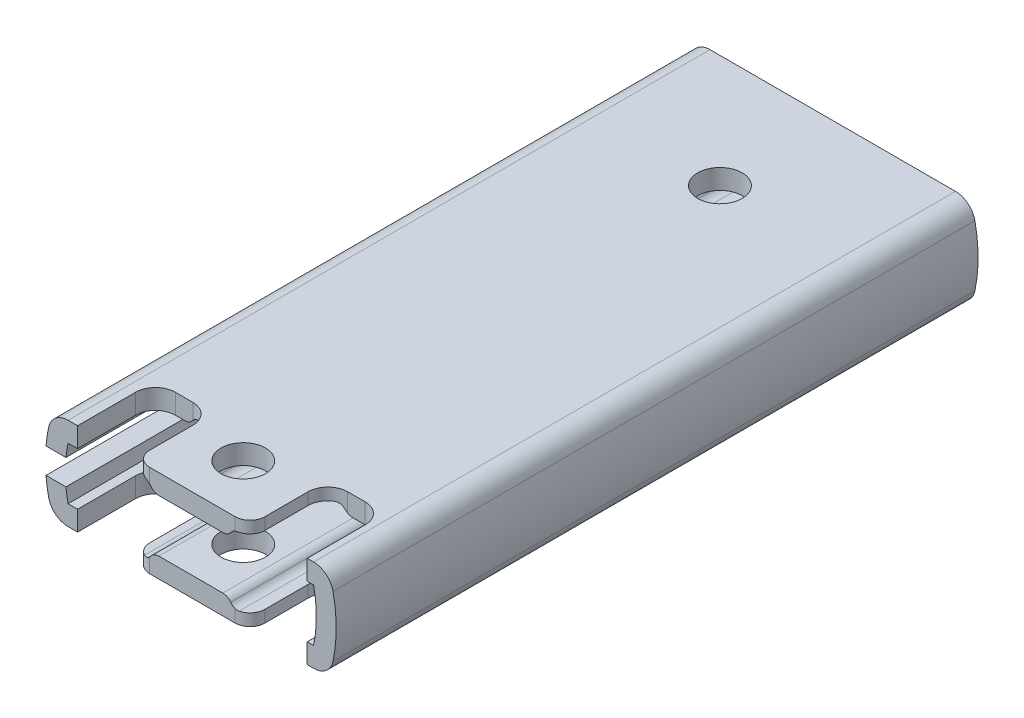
ISO-10303-21;
HEADER;
FILE_DESCRIPTION(('STEP AP214'),'2;1');
FILE_NAME('part.step','',(''),(''),'','','');
FILE_SCHEMA(('AUTOMOTIVE_DESIGN { 1 0 10303 214 1 1 1 1 }'));
ENDSEC;
DATA;
#1=APPLICATION_CONTEXT('core data for automotive mechanical design processes');
#2=APPLICATION_PROTOCOL_DEFINITION('international standard','automotive_design',2000,#1);
#3=PRODUCT_CONTEXT('',#1,'mechanical');
#4=PRODUCT('Part','Part','',(#3));
#5=PRODUCT_RELATED_PRODUCT_CATEGORY('part','',(#4));
#6=PRODUCT_DEFINITION_FORMATION('','',#4);
#7=PRODUCT_DEFINITION_CONTEXT('part definition',#1,'design');
#8=PRODUCT_DEFINITION('design','',#6,#7);
#9=PRODUCT_DEFINITION_SHAPE('','',#8);
#10=(LENGTH_UNIT() NAMED_UNIT(*) SI_UNIT(.MILLI.,.METRE.));
#11=(NAMED_UNIT(*) PLANE_ANGLE_UNIT() SI_UNIT($,.RADIAN.));
#12=(NAMED_UNIT(*) SI_UNIT($,.STERADIAN.) SOLID_ANGLE_UNIT());
#13=UNCERTAINTY_MEASURE_WITH_UNIT(LENGTH_MEASURE(1.E-05),#10,'distance_accuracy_value','');
#14=(GEOMETRIC_REPRESENTATION_CONTEXT(3) GLOBAL_UNCERTAINTY_ASSIGNED_CONTEXT((#13)) GLOBAL_UNIT_ASSIGNED_CONTEXT((#10,
#11,#12)) REPRESENTATION_CONTEXT('',''));
#15=CARTESIAN_POINT('',(0.,0.,0.));
#16=DIRECTION('',(0.,0.,1.));
#17=DIRECTION('',(1.,0.,0.));
#18=AXIS2_PLACEMENT_3D('',#15,#16,#17);
#19=CARTESIAN_POINT('',(0.,0.,25.654));
#20=DIRECTION('',(0.,0.,-1.));
#21=DIRECTION('',(-1.,0.,0.));
#22=AXIS2_PLACEMENT_3D('',#19,#20,#21);
#23=PLANE('',#22);
#24=CARTESIAN_POINT('',(-2.55571299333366,-2.88925,25.654));
#25=DIRECTION('',(0.,0.,1.));
#26=DIRECTION('',(-1.,0.,0.));
#27=AXIS2_PLACEMENT_3D('',#24,#25,#26);
#28=CIRCLE('',#27,0.79375);
#29=CARTESIAN_POINT('',(-3.19071299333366,-2.41299999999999,25.654));
#30=VERTEX_POINT('',#29);
#31=CARTESIAN_POINT('',(-2.55571299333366,-2.0955,25.654));
#32=VERTEX_POINT('',#31);
#33=EDGE_CURVE('E475',#30,#32,#28,.F.);
#34=ORIENTED_EDGE('',*,*,#33,.F.);
#35=CARTESIAN_POINT('',(-3.82571299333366,-1.93674999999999,25.654));
#36=DIRECTION('',(0.,0.,1.));
#37=DIRECTION('',(-1.,0.,0.));
#38=AXIS2_PLACEMENT_3D('',#35,#36,#37);
#39=CIRCLE('',#38,0.79375);
#40=CARTESIAN_POINT('',(-3.28710108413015,-2.51979054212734,25.654));
#41=VERTEX_POINT('',#40);
#42=EDGE_CURVE('E464',#41,#30,#39,.T.);
#43=ORIENTED_EDGE('',*,*,#42,.F.);
#44=DIRECTION('',(0.,1.,0.));
#45=VECTOR('',#44,1.);
#46=CARTESIAN_POINT('',(-3.28710108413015,0.,25.654));
#47=LINE('',#46,#45);
#48=CARTESIAN_POINT('',(-3.28710108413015,-3.683,25.654));
#49=VERTEX_POINT('',#48);
#50=EDGE_CURVE('E905',#41,#49,#47,.F.);
#51=ORIENTED_EDGE('',*,*,#50,.T.);
#52=DIRECTION('',(1.,0.,0.));
#53=VECTOR('',#52,1.);
#54=CARTESIAN_POINT('',(-11.0214123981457,-3.683,25.654));
#55=LINE('',#54,#53);
#56=CARTESIAN_POINT('',(3.54110108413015,-3.68299999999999,25.654));
#57=VERTEX_POINT('',#56);
#58=EDGE_CURVE('E1080',#49,#57,#55,.T.);
#59=ORIENTED_EDGE('',*,*,#58,.T.);
#60=DIRECTION('',(0.,1.,0.));
#61=VECTOR('',#60,1.);
#62=CARTESIAN_POINT('',(3.54110108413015,0.,25.654));
#63=LINE('',#62,#61);
#64=CARTESIAN_POINT('',(3.54110108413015,-2.67771904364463,25.654));
#65=VERTEX_POINT('',#64);
#66=EDGE_CURVE('E901',#57,#65,#63,.T.);
#67=ORIENTED_EDGE('',*,*,#66,.T.);
#68=CARTESIAN_POINT('',(3.82571299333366,-1.93674999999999,25.654));
#69=DIRECTION('',(0.,0.,1.));
#70=DIRECTION('',(-1.,0.,0.));
#71=AXIS2_PLACEMENT_3D('',#68,#69,#70);
#72=CIRCLE('',#71,0.79375);
#73=CARTESIAN_POINT('',(3.19071299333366,-2.41299999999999,25.654));
#74=VERTEX_POINT('',#73);
#75=EDGE_CURVE('E578',#74,#65,#72,.T.);
#76=ORIENTED_EDGE('',*,*,#75,.F.);
#77=CARTESIAN_POINT('',(2.55571299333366,-2.88925,25.654));
#78=DIRECTION('',(0.,0.,1.));
#79=DIRECTION('',(-1.,0.,0.));
#80=AXIS2_PLACEMENT_3D('',#77,#78,#79);
#81=CIRCLE('',#80,0.79375);
#82=CARTESIAN_POINT('',(2.55571299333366,-2.0955,25.654));
#83=VERTEX_POINT('',#82);
#84=EDGE_CURVE('E589',#83,#74,#81,.F.);
#85=ORIENTED_EDGE('',*,*,#84,.F.);
#86=DIRECTION('',(1.,0.,0.));
#87=VECTOR('',#86,1.);
#88=CARTESIAN_POINT('',(-9.81172608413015,-2.09549999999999,25.654));
#89=LINE('',#88,#87);
#90=EDGE_CURVE('E1048',#32,#83,#89,.T.);
#91=ORIENTED_EDGE('',*,*,#90,.F.);
#92=EDGE_LOOP('',(#34,#43,#51,#59,#67,#76,#85,#91));
#93=FACE_BOUND('',#92,.T.);
#94=ADVANCED_FACE('F33',(#93),#23,.F.);
#95=CARTESIAN_POINT('',(-9.81172608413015,-2.09549999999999,25.654));
#96=DIRECTION('',(0.,1.,0.));
#97=DIRECTION('',(-1.,0.,0.));
#98=AXIS2_PLACEMENT_3D('',#95,#96,#97);
#99=PLANE('',#98);
#100=DIRECTION('',(0.,0.,-1.));
#101=VECTOR('',#100,1.);
#102=CARTESIAN_POINT('',(-6.71528700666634,-2.09549999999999,19.431));
#103=LINE('',#102,#101);
#104=CARTESIAN_POINT('',(-6.71528700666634,-2.09549999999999,-25.654));
#105=VERTEX_POINT('',#104);
#106=CARTESIAN_POINT('',(-6.71528700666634,-2.09549999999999,19.431));
#107=VERTEX_POINT('',#106);
#108=EDGE_CURVE('E1871',#105,#107,#103,.F.);
#109=ORIENTED_EDGE('',*,*,#108,.F.);
#110=DIRECTION('',(1.,0.,0.));
#111=VECTOR('',#110,1.);
#112=CARTESIAN_POINT('',(-9.81172608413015,-2.09549999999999,-25.654));
#113=LINE('',#112,#111);
#114=CARTESIAN_POINT('',(-9.81172608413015,-2.09549999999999,-25.654));
#115=VERTEX_POINT('',#114);
#116=EDGE_CURVE('E1059',#115,#105,#113,.T.);
#117=ORIENTED_EDGE('',*,*,#116,.F.);
#118=DIRECTION('',(0.,0.,-1.));
#119=VECTOR('',#118,1.);
#120=CARTESIAN_POINT('',(-9.81172608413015,-2.09549999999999,25.654));
#121=LINE('',#120,#119);
#122=CARTESIAN_POINT('',(-9.81172608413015,-2.09549999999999,25.654));
#123=VERTEX_POINT('',#122);
#124=EDGE_CURVE('E650',#123,#115,#121,.T.);
#125=ORIENTED_EDGE('',*,*,#124,.F.);
#126=CARTESIAN_POINT('',(-9.04972608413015,-2.09549999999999,25.654));
#127=VERTEX_POINT('',#126);
#128=EDGE_CURVE('E1044',#123,#127,#89,.T.);
#129=ORIENTED_EDGE('',*,*,#128,.T.);
#130=DIRECTION('',(0.,0.,1.));
#131=VECTOR('',#130,1.);
#132=CARTESIAN_POINT('',(-9.04972608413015,-2.09549999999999,25.654));
#133=LINE('',#132,#131);
#134=CARTESIAN_POINT('',(-9.04972608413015,-2.09549999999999,21.0185));
#135=VERTEX_POINT('',#134);
#136=EDGE_CURVE('E1023',#135,#127,#133,.T.);
#137=ORIENTED_EDGE('',*,*,#136,.F.);
#138=CARTESIAN_POINT('',(-7.46222608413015,-2.09549999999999,21.0185));
#139=DIRECTION('',(0.,1.,0.));
#140=DIRECTION('',(-1.,0.,0.));
#141=AXIS2_PLACEMENT_3D('',#138,#139,#140);
#142=CIRCLE('',#141,1.5875);
#143=CARTESIAN_POINT('',(-7.46222608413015,-2.09549999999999,19.431));
#144=VERTEX_POINT('',#143);
#145=EDGE_CURVE('E1149',#135,#144,#142,.F.);
#146=ORIENTED_EDGE('',*,*,#145,.T.);
#147=DIRECTION('',(-1.,0.,0.));
#148=VECTOR('',#147,1.);
#149=CARTESIAN_POINT('',(-9.81172608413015,-2.09549999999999,19.431));
#150=LINE('',#149,#148);
#151=EDGE_CURVE('E1021',#107,#144,#150,.T.);
#152=ORIENTED_EDGE('',*,*,#151,.F.);
#153=EDGE_LOOP('',(#109,#117,#125,#129,#137,#146,#152));
#154=FACE_BOUND('',#153,.T.);
#155=ADVANCED_FACE('F602',(#154),#99,.T.);
#156=CARTESIAN_POINT('',(0.,0.,-25.654));
#157=DIRECTION('',(0.,0.,-1.));
#158=DIRECTION('',(-1.,0.,0.));
#159=AXIS2_PLACEMENT_3D('',#156,#157,#158);
#160=PLANE('',#159);
#161=ORIENTED_EDGE('',*,*,#116,.T.);
#162=CARTESIAN_POINT('',(-6.71528700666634,-2.88924999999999,-25.654));
#163=DIRECTION('',(0.,0.,1.));
#164=DIRECTION('',(-1.,0.,0.));
#165=AXIS2_PLACEMENT_3D('',#162,#163,#164);
#166=CIRCLE('',#165,0.79375);
#167=CARTESIAN_POINT('',(-6.08028700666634,-2.41299999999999,-25.654));
#168=VERTEX_POINT('',#167);
#169=EDGE_CURVE('E1249',#168,#105,#166,.T.);
#170=ORIENTED_EDGE('',*,*,#169,.F.);
#171=CARTESIAN_POINT('',(-5.44528700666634,-1.93674999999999,-25.654));
#172=DIRECTION('',(0.,0.,1.));
#173=DIRECTION('',(-1.,0.,0.));
#174=AXIS2_PLACEMENT_3D('',#171,#172,#173);
#175=CIRCLE('',#174,0.79375);
#176=CARTESIAN_POINT('',(-5.44528700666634,-2.73049999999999,-25.654));
#177=VERTEX_POINT('',#176);
#178=EDGE_CURVE('E519',#177,#168,#175,.F.);
#179=ORIENTED_EDGE('',*,*,#178,.F.);
#180=DIRECTION('',(1.,0.,0.));
#181=VECTOR('',#180,1.);
#182=CARTESIAN_POINT('',(-6.223,-2.73049999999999,-25.654));
#183=LINE('',#182,#181);
#184=CARTESIAN_POINT('',(-3.82571299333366,-2.73049999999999,-25.654));
#185=VERTEX_POINT('',#184);
#186=EDGE_CURVE('E481',#177,#185,#183,.T.);
#187=ORIENTED_EDGE('',*,*,#186,.T.);
#188=CARTESIAN_POINT('',(-3.82571299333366,-1.93674999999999,-25.654));
#189=DIRECTION('',(0.,0.,1.));
#190=DIRECTION('',(-1.,0.,0.));
#191=AXIS2_PLACEMENT_3D('',#188,#189,#190);
#192=CIRCLE('',#191,0.79375);
#193=CARTESIAN_POINT('',(-3.19071299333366,-2.41299999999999,-25.654));
#194=VERTEX_POINT('',#193);
#195=EDGE_CURVE('E461',#194,#185,#192,.F.);
#196=ORIENTED_EDGE('',*,*,#195,.F.);
#197=CARTESIAN_POINT('',(-2.55571299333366,-2.88925,-25.654));
#198=DIRECTION('',(0.,0.,1.));
#199=DIRECTION('',(-1.,0.,0.));
#200=AXIS2_PLACEMENT_3D('',#197,#198,#199);
#201=CIRCLE('',#200,0.79375);
#202=CARTESIAN_POINT('',(-2.55571299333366,-2.0955,-25.654));
#203=VERTEX_POINT('',#202);
#204=EDGE_CURVE('E469',#203,#194,#201,.T.);
#205=ORIENTED_EDGE('',*,*,#204,.F.);
#206=CARTESIAN_POINT('',(2.55571299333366,-2.0955,-25.654));
#207=VERTEX_POINT('',#206);
#208=EDGE_CURVE('E1062',#203,#207,#113,.T.);
#209=ORIENTED_EDGE('',*,*,#208,.T.);
#210=CARTESIAN_POINT('',(2.55571299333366,-2.88925,-25.654));
#211=DIRECTION('',(0.,0.,1.));
#212=DIRECTION('',(-1.,0.,0.));
#213=AXIS2_PLACEMENT_3D('',#210,#211,#212);
#214=CIRCLE('',#213,0.79375);
#215=CARTESIAN_POINT('',(3.19071299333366,-2.41299999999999,-25.654));
#216=VERTEX_POINT('',#215);
#217=EDGE_CURVE('E1217',#216,#207,#214,.T.);
#218=ORIENTED_EDGE('',*,*,#217,.F.);
#219=CARTESIAN_POINT('',(3.82571299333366,-1.93674999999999,-25.654));
#220=DIRECTION('',(0.,0.,1.));
#221=DIRECTION('',(-1.,0.,0.));
#222=AXIS2_PLACEMENT_3D('',#219,#220,#221);
#223=CIRCLE('',#222,0.79375);
#224=CARTESIAN_POINT('',(3.82571299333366,-2.73049999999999,-25.654));
#225=VERTEX_POINT('',#224);
#226=EDGE_CURVE('E582',#225,#216,#223,.F.);
#227=ORIENTED_EDGE('',*,*,#226,.F.);
#228=DIRECTION('',(1.,0.,0.));
#229=VECTOR('',#228,1.);
#230=CARTESIAN_POINT('',(6.223,-2.73049999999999,-25.654));
#231=LINE('',#230,#229);
#232=CARTESIAN_POINT('',(5.44528700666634,-2.73049999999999,-25.654));
#233=VERTEX_POINT('',#232);
#234=EDGE_CURVE('E570',#225,#233,#231,.T.);
#235=ORIENTED_EDGE('',*,*,#234,.T.);
#236=CARTESIAN_POINT('',(5.44528700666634,-1.93674999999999,-25.654));
#237=DIRECTION('',(0.,0.,1.));
#238=DIRECTION('',(-1.,0.,0.));
#239=AXIS2_PLACEMENT_3D('',#236,#237,#238);
#240=CIRCLE('',#239,0.79375);
#241=CARTESIAN_POINT('',(6.08028700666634,-2.41299999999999,-25.654));
#242=VERTEX_POINT('',#241);
#243=EDGE_CURVE('E1247',#242,#233,#240,.F.);
#244=ORIENTED_EDGE('',*,*,#243,.F.);
#245=CARTESIAN_POINT('',(6.71528700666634,-2.88925,-25.654));
#246=DIRECTION('',(0.,0.,1.));
#247=DIRECTION('',(-1.,0.,0.));
#248=AXIS2_PLACEMENT_3D('',#245,#246,#247);
#249=CIRCLE('',#248,0.79375);
#250=CARTESIAN_POINT('',(6.71528700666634,-2.0955,-25.654));
#251=VERTEX_POINT('',#250);
#252=EDGE_CURVE('E558',#251,#242,#249,.T.);
#253=ORIENTED_EDGE('',*,*,#252,.F.);
#254=CARTESIAN_POINT('',(9.81172608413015,-2.09549999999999,-25.654));
#255=VERTEX_POINT('',#254);
#256=EDGE_CURVE('E1058',#251,#255,#113,.T.);
#257=ORIENTED_EDGE('',*,*,#256,.T.);
#258=CARTESIAN_POINT('',(0.,0.,-25.654));
#259=DIRECTION('',(0.,0.,1.));
#260=DIRECTION('',(1.,0.,0.));
#261=AXIS2_PLACEMENT_3D('',#258,#259,#260);
#262=CIRCLE('',#261,10.033);
#263=CARTESIAN_POINT('',(9.81172608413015,2.09549999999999,-25.654));
#264=VERTEX_POINT('',#263);
#265=EDGE_CURVE('E1061',#255,#264,#262,.T.);
#266=ORIENTED_EDGE('',*,*,#265,.T.);
#267=DIRECTION('',(-1.,0.,0.));
#268=VECTOR('',#267,1.);
#269=CARTESIAN_POINT('',(-9.81172608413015,2.09549999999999,-25.654));
#270=LINE('',#269,#268);
#271=CARTESIAN_POINT('',(6.71528700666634,2.0955,-25.654));
#272=VERTEX_POINT('',#271);
#273=EDGE_CURVE('E1064',#264,#272,#270,.T.);
#274=ORIENTED_EDGE('',*,*,#273,.T.);
#275=CARTESIAN_POINT('',(6.71528700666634,2.88925,-25.654));
#276=DIRECTION('',(0.,0.,-1.));
#277=DIRECTION('',(-1.,0.,0.));
#278=AXIS2_PLACEMENT_3D('',#275,#276,#277);
#279=CIRCLE('',#278,0.79375);
#280=CARTESIAN_POINT('',(6.08028700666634,2.41299999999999,-25.654));
#281=VERTEX_POINT('',#280);
#282=EDGE_CURVE('E1272',#272,#281,#279,.T.);
#283=ORIENTED_EDGE('',*,*,#282,.T.);
#284=CARTESIAN_POINT('',(5.44528700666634,1.93674999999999,-25.654));
#285=DIRECTION('',(0.,0.,-1.));
#286=DIRECTION('',(-1.,0.,0.));
#287=AXIS2_PLACEMENT_3D('',#284,#285,#286);
#288=CIRCLE('',#287,0.79375);
#289=CARTESIAN_POINT('',(5.44528700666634,2.73049999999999,-25.654));
#290=VERTEX_POINT('',#289);
#291=EDGE_CURVE('E766',#281,#290,#288,.F.);
#292=ORIENTED_EDGE('',*,*,#291,.T.);
#293=DIRECTION('',(1.,0.,0.));
#294=VECTOR('',#293,1.);
#295=CARTESIAN_POINT('',(6.223,2.73049999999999,-25.654));
#296=LINE('',#295,#294);
#297=CARTESIAN_POINT('',(3.82571299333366,2.73049999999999,-25.654));
#298=VERTEX_POINT('',#297);
#299=EDGE_CURVE('E1210',#298,#290,#296,.T.);
#300=ORIENTED_EDGE('',*,*,#299,.F.);
#301=CARTESIAN_POINT('',(3.82571299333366,1.93674999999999,-25.654));
#302=DIRECTION('',(0.,0.,-1.));
#303=DIRECTION('',(-1.,0.,0.));
#304=AXIS2_PLACEMENT_3D('',#301,#302,#303);
#305=CIRCLE('',#304,0.79375);
#306=CARTESIAN_POINT('',(3.19071299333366,2.41299999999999,-25.654));
#307=VERTEX_POINT('',#306);
#308=EDGE_CURVE('E698',#298,#307,#305,.F.);
#309=ORIENTED_EDGE('',*,*,#308,.T.);
#310=CARTESIAN_POINT('',(2.55571299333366,2.88925,-25.654));
#311=DIRECTION('',(0.,0.,-1.));
#312=DIRECTION('',(-1.,0.,0.));
#313=AXIS2_PLACEMENT_3D('',#310,#311,#312);
#314=CIRCLE('',#313,0.79375);
#315=CARTESIAN_POINT('',(2.55571299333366,2.0955,-25.654));
#316=VERTEX_POINT('',#315);
#317=EDGE_CURVE('E1354',#307,#316,#314,.T.);
#318=ORIENTED_EDGE('',*,*,#317,.T.);
#319=CARTESIAN_POINT('',(-2.55571299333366,2.0955,-25.654));
#320=VERTEX_POINT('',#319);
#321=EDGE_CURVE('E1066',#316,#320,#270,.T.);
#322=ORIENTED_EDGE('',*,*,#321,.T.);
#323=CARTESIAN_POINT('',(-2.55571299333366,2.88925,-25.654));
#324=DIRECTION('',(0.,0.,-1.));
#325=DIRECTION('',(-1.,0.,0.));
#326=AXIS2_PLACEMENT_3D('',#323,#324,#325);
#327=CIRCLE('',#326,0.79375);
#328=CARTESIAN_POINT('',(-3.19071299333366,2.41299999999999,-25.654));
#329=VERTEX_POINT('',#328);
#330=EDGE_CURVE('E1744',#320,#329,#327,.T.);
#331=ORIENTED_EDGE('',*,*,#330,.T.);
#332=CARTESIAN_POINT('',(-3.82571299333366,1.93674999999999,-25.654));
#333=DIRECTION('',(0.,0.,-1.));
#334=DIRECTION('',(-1.,0.,0.));
#335=AXIS2_PLACEMENT_3D('',#332,#333,#334);
#336=CIRCLE('',#335,0.79375);
#337=CARTESIAN_POINT('',(-3.82571299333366,2.73049999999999,-25.654));
#338=VERTEX_POINT('',#337);
#339=EDGE_CURVE('E740',#329,#338,#336,.F.);
#340=ORIENTED_EDGE('',*,*,#339,.T.);
#341=DIRECTION('',(1.,0.,0.));
#342=VECTOR('',#341,1.);
#343=CARTESIAN_POINT('',(-6.223,2.73049999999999,-25.654));
#344=LINE('',#343,#342);
#345=CARTESIAN_POINT('',(-5.44528700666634,2.73049999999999,-25.654));
#346=VERTEX_POINT('',#345);
#347=EDGE_CURVE('E869',#346,#338,#344,.T.);
#348=ORIENTED_EDGE('',*,*,#347,.F.);
#349=CARTESIAN_POINT('',(-5.44528700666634,1.93674999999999,-25.654));
#350=DIRECTION('',(0.,0.,-1.));
#351=DIRECTION('',(-1.,0.,0.));
#352=AXIS2_PLACEMENT_3D('',#349,#350,#351);
#353=CIRCLE('',#352,0.79375);
#354=CARTESIAN_POINT('',(-6.08028700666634,2.41299999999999,-25.654));
#355=VERTEX_POINT('',#354);
#356=EDGE_CURVE('E710',#346,#355,#353,.F.);
#357=ORIENTED_EDGE('',*,*,#356,.T.);
#358=CARTESIAN_POINT('',(-6.71528700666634,2.88924999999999,-25.654));
#359=DIRECTION('',(0.,0.,-1.));
#360=DIRECTION('',(-1.,0.,0.));
#361=AXIS2_PLACEMENT_3D('',#358,#359,#360);
#362=CIRCLE('',#361,0.79375);
#363=CARTESIAN_POINT('',(-6.71528700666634,2.09549999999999,-25.654));
#364=VERTEX_POINT('',#363);
#365=EDGE_CURVE('E861',#355,#364,#362,.T.);
#366=ORIENTED_EDGE('',*,*,#365,.T.);
#367=CARTESIAN_POINT('',(-9.81172608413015,2.09549999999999,-25.654));
#368=VERTEX_POINT('',#367);
#369=EDGE_CURVE('E849',#364,#368,#270,.T.);
#370=ORIENTED_EDGE('',*,*,#369,.T.);
#371=CARTESIAN_POINT('',(0.,0.,-25.654));
#372=DIRECTION('',(0.,0.,1.));
#373=DIRECTION('',(-1.,0.,0.));
#374=AXIS2_PLACEMENT_3D('',#371,#372,#373);
#375=CIRCLE('',#374,10.033);
#376=CARTESIAN_POINT('',(-9.98142439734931,1.016,-25.654));
#377=VERTEX_POINT('',#376);
#378=EDGE_CURVE('E1056',#368,#377,#375,.T.);
#379=ORIENTED_EDGE('',*,*,#378,.T.);
#380=DIRECTION('',(-1.,0.,0.));
#381=VECTOR('',#380,1.);
#382=CARTESIAN_POINT('',(9.98142439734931,1.016,-25.654));
#383=LINE('',#382,#381);
#384=CARTESIAN_POINT('',(-11.5759994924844,1.016,-25.654));
#385=VERTEX_POINT('',#384);
#386=EDGE_CURVE('E1092',#377,#385,#383,.T.);
#387=ORIENTED_EDGE('',*,*,#386,.T.);
#388=CARTESIAN_POINT('',(0.,0.,-25.654));
#389=DIRECTION('',(0.,0.,-1.));
#390=DIRECTION('',(-1.,0.,0.));
#391=AXIS2_PLACEMENT_3D('',#388,#389,#390);
#392=CIRCLE('',#391,11.6205);
#393=CARTESIAN_POINT('',(-11.3642143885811,2.4270664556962,-25.654));
#394=VERTEX_POINT('',#393);
#395=EDGE_CURVE('E954',#385,#394,#392,.T.);
#396=ORIENTED_EDGE('',*,*,#395,.T.);
#397=CARTESIAN_POINT('',(-9.81172608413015,2.0955,-25.654));
#398=DIRECTION('',(0.,0.,-1.));
#399=DIRECTION('',(-1.,0.,0.));
#400=AXIS2_PLACEMENT_3D('',#397,#398,#399);
#401=CIRCLE('',#400,1.5875);
#402=CARTESIAN_POINT('',(-9.81172608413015,3.68299999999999,-25.654));
#403=VERTEX_POINT('',#402);
#404=EDGE_CURVE('E935',#394,#403,#401,.T.);
#405=ORIENTED_EDGE('',*,*,#404,.T.);
#406=DIRECTION('',(1.,0.,0.));
#407=VECTOR('',#406,1.);
#408=CARTESIAN_POINT('',(12.7,3.68299999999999,-25.654));
#409=LINE('',#408,#407);
#410=CARTESIAN_POINT('',(9.81172608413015,3.68299999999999,-25.654));
#411=VERTEX_POINT('',#410);
#412=EDGE_CURVE('E1202',#403,#411,#409,.T.);
#413=ORIENTED_EDGE('',*,*,#412,.T.);
#414=CARTESIAN_POINT('',(9.81172608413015,2.0955,-25.654));
#415=DIRECTION('',(0.,0.,-1.));
#416=DIRECTION('',(-1.,0.,0.));
#417=AXIS2_PLACEMENT_3D('',#414,#415,#416);
#418=CIRCLE('',#417,1.5875);
#419=CARTESIAN_POINT('',(11.3642143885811,2.4270664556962,-25.654));
#420=VERTEX_POINT('',#419);
#421=EDGE_CURVE('E937',#411,#420,#418,.T.);
#422=ORIENTED_EDGE('',*,*,#421,.T.);
#423=CARTESIAN_POINT('',(0.,0.,-25.654));
#424=DIRECTION('',(0.,0.,-1.));
#425=DIRECTION('',(-1.,0.,0.));
#426=AXIS2_PLACEMENT_3D('',#423,#424,#425);
#427=CIRCLE('',#426,11.6205);
#428=CARTESIAN_POINT('',(11.3642143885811,-2.42706645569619,-25.654));
#429=VERTEX_POINT('',#428);
#430=EDGE_CURVE('E948',#420,#429,#427,.T.);
#431=ORIENTED_EDGE('',*,*,#430,.T.);
#432=CARTESIAN_POINT('',(9.81172608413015,-2.09549999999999,-25.654));
#433=DIRECTION('',(0.,0.,-1.));
#434=DIRECTION('',(-1.,0.,0.));
#435=AXIS2_PLACEMENT_3D('',#432,#433,#434);
#436=CIRCLE('',#435,1.5875);
#437=CARTESIAN_POINT('',(9.81172608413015,-3.68299999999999,-25.654));
#438=VERTEX_POINT('',#437);
#439=EDGE_CURVE('E939',#429,#438,#436,.T.);
#440=ORIENTED_EDGE('',*,*,#439,.T.);
#441=DIRECTION('',(-1.,0.,0.));
#442=VECTOR('',#441,1.);
#443=CARTESIAN_POINT('',(12.7,-3.68299999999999,-25.654));
#444=LINE('',#443,#442);
#445=CARTESIAN_POINT('',(-9.81172608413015,-3.68299999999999,-25.654));
#446=VERTEX_POINT('',#445);
#447=EDGE_CURVE('E945',#438,#446,#444,.T.);
#448=ORIENTED_EDGE('',*,*,#447,.T.);
#449=CARTESIAN_POINT('',(-9.81172608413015,-2.0955,-25.654));
#450=DIRECTION('',(0.,0.,-1.));
#451=DIRECTION('',(-1.,0.,0.));
#452=AXIS2_PLACEMENT_3D('',#449,#450,#451);
#453=CIRCLE('',#452,1.5875);
#454=CARTESIAN_POINT('',(-11.3642143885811,-2.42706645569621,-25.654));
#455=VERTEX_POINT('',#454);
#456=EDGE_CURVE('E663',#446,#455,#453,.T.);
#457=ORIENTED_EDGE('',*,*,#456,.T.);
#458=CARTESIAN_POINT('',(0.,0.,-25.654));
#459=DIRECTION('',(0.,0.,-1.));
#460=DIRECTION('',(-1.,0.,0.));
#461=AXIS2_PLACEMENT_3D('',#458,#459,#460);
#462=CIRCLE('',#461,11.6205);
#463=CARTESIAN_POINT('',(-11.5759994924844,-1.016,-25.654));
#464=VERTEX_POINT('',#463);
#465=EDGE_CURVE('E942',#455,#464,#462,.T.);
#466=ORIENTED_EDGE('',*,*,#465,.T.);
#467=DIRECTION('',(1.,0.,0.));
#468=VECTOR('',#467,1.);
#469=CARTESIAN_POINT('',(9.98142439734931,-1.016,-25.654));
#470=LINE('',#469,#468);
#471=CARTESIAN_POINT('',(-9.98142439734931,-1.016,-25.654));
#472=VERTEX_POINT('',#471);
#473=EDGE_CURVE('E949',#464,#472,#470,.T.);
#474=ORIENTED_EDGE('',*,*,#473,.T.);
#475=EDGE_CURVE('E1038',#472,#115,#375,.T.);
#476=ORIENTED_EDGE('',*,*,#475,.T.);
#477=EDGE_LOOP('',(#161,#170,#179,#187,#196,#205,#209,#218,#227,#235,#244,#253,#257,#266,#274,
#283,#292,#300,#309,#318,#322,#331,#340,#348,#357,#366,#370,#379,#387,#396,#405,#413,#422,#431,
#440,#448,#457,#466,#474,#476));
#478=FACE_BOUND('',#477,.T.);
#479=ADVANCED_FACE('F478',(#478),#160,.T.);
#480=CARTESIAN_POINT('',(-9.04972608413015,-3.68300000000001,19.431));
#481=DIRECTION('',(0.,0.,-1.));
#482=DIRECTION('',(-1.,0.,0.));
#483=AXIS2_PLACEMENT_3D('',#480,#481,#482);
#484=PLANE('',#483);
#485=CARTESIAN_POINT('',(-6.71528700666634,-2.88924999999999,19.431));
#486=DIRECTION('',(0.,0.,1.));
#487=DIRECTION('',(-1.,0.,0.));
#488=AXIS2_PLACEMENT_3D('',#485,#486,#487);
#489=CIRCLE('',#488,0.79375);
#490=CARTESIAN_POINT('',(-6.08028700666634,-2.41299999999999,19.431));
#491=VERTEX_POINT('',#490);
#492=EDGE_CURVE('E518',#107,#491,#489,.F.);
#493=ORIENTED_EDGE('',*,*,#492,.F.);
#494=ORIENTED_EDGE('',*,*,#151,.T.);
#495=DIRECTION('',(0.,1.,0.));
#496=VECTOR('',#495,1.);
#497=CARTESIAN_POINT('',(-7.46222608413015,-3.68300000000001,19.431));
#498=LINE('',#497,#496);
#499=CARTESIAN_POINT('',(-7.46222608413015,-3.68300000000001,19.431));
#500=VERTEX_POINT('',#499);
#501=EDGE_CURVE('E1115',#144,#500,#498,.F.);
#502=ORIENTED_EDGE('',*,*,#501,.T.);
#503=DIRECTION('',(-1.,0.,0.));
#504=VECTOR('',#503,1.);
#505=CARTESIAN_POINT('',(-9.04972608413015,-3.68300000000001,19.431));
#506=LINE('',#505,#504);
#507=CARTESIAN_POINT('',(-6.06522608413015,-3.68300000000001,19.431));
#508=VERTEX_POINT('',#507);
#509=EDGE_CURVE('E1014',#508,#500,#506,.T.);
#510=ORIENTED_EDGE('',*,*,#509,.F.);
#511=DIRECTION('',(0.,1.,0.));
#512=VECTOR('',#511,1.);
#513=CARTESIAN_POINT('',(-6.06522608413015,-2.09549999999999,19.431));
#514=LINE('',#513,#512);
#515=CARTESIAN_POINT('',(-6.06522608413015,-2.43244607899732,19.431));
#516=VERTEX_POINT('',#515);
#517=EDGE_CURVE('E1117',#508,#516,#514,.T.);
#518=ORIENTED_EDGE('',*,*,#517,.T.);
#519=CARTESIAN_POINT('',(-5.44528700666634,-1.93674999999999,19.431));
#520=DIRECTION('',(0.,0.,1.));
#521=DIRECTION('',(-1.,0.,0.));
#522=AXIS2_PLACEMENT_3D('',#519,#520,#521);
#523=CIRCLE('',#522,0.79375);
#524=EDGE_CURVE('E1302',#491,#516,#523,.T.);
#525=ORIENTED_EDGE('',*,*,#524,.F.);
#526=EDGE_LOOP('',(#493,#494,#502,#510,#518,#525));
#527=FACE_BOUND('',#526,.T.);
#528=ADVANCED_FACE('F1301',(#527),#484,.F.);
#529=DIRECTION('',(0.,0.,1.));
#530=VECTOR('',#529,1.);
#531=CARTESIAN_POINT('',(-2.55571299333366,-2.0955,-25.654));
#532=LINE('',#531,#530);
#533=EDGE_CURVE('E472',#32,#203,#532,.F.);
#534=ORIENTED_EDGE('',*,*,#533,.F.);
#535=ORIENTED_EDGE('',*,*,#90,.T.);
#536=DIRECTION('',(0.,0.,-1.));
#537=VECTOR('',#536,1.);
#538=CARTESIAN_POINT('',(2.55571299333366,-2.0955,25.654));
#539=LINE('',#538,#537);
#540=EDGE_CURVE('E1219',#207,#83,#539,.F.);
#541=ORIENTED_EDGE('',*,*,#540,.F.);
#542=ORIENTED_EDGE('',*,*,#208,.F.);
#543=EDGE_LOOP('',(#534,#535,#541,#542));
#544=FACE_BOUND('',#543,.T.);
#545=CARTESIAN_POINT('',(0.,-2.09549999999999,-16.637));
#546=DIRECTION('',(0.,1.,0.));
#547=DIRECTION('',(-1.,0.,0.));
#548=AXIS2_PLACEMENT_3D('',#545,#546,#547);
#549=CIRCLE('',#548,1.778);
#550=CARTESIAN_POINT('',(-1.778,-2.09549999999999,-16.637));
#551=VERTEX_POINT('',#550);
#552=EDGE_CURVE('E964',#551,#551,#549,.T.);
#553=ORIENTED_EDGE('',*,*,#552,.F.);
#554=EDGE_LOOP('',(#553));
#555=FACE_BOUND('',#554,.T.);
#556=CARTESIAN_POINT('',(0.,-2.09549999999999,21.463));
#557=DIRECTION('',(0.,1.,0.));
#558=DIRECTION('',(-1.,0.,0.));
#559=AXIS2_PLACEMENT_3D('',#556,#557,#558);
#560=CIRCLE('',#559,1.778);
#561=CARTESIAN_POINT('',(-1.778,-2.09549999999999,21.463));
#562=VERTEX_POINT('',#561);
#563=EDGE_CURVE('E974',#562,#562,#560,.T.);
#564=ORIENTED_EDGE('',*,*,#563,.F.);
#565=EDGE_LOOP('',(#564));
#566=FACE_BOUND('',#565,.T.);
#567=ADVANCED_FACE('F612',(#544,#555,#566),#99,.T.);
#568=CARTESIAN_POINT('',(9.30372608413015,-3.683,19.431));
#569=DIRECTION('',(0.,0.,-1.));
#570=DIRECTION('',(-1.,0.,0.));
#571=AXIS2_PLACEMENT_3D('',#568,#569,#570);
#572=PLANE('',#571);
#573=CARTESIAN_POINT('',(6.71528700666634,-2.88925,19.431));
#574=DIRECTION('',(0.,0.,1.));
#575=DIRECTION('',(-1.,0.,0.));
#576=AXIS2_PLACEMENT_3D('',#573,#574,#575);
#577=CIRCLE('',#576,0.79375);
#578=CARTESIAN_POINT('',(6.31922608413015,-2.20137297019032,19.431));
#579=VERTEX_POINT('',#578);
#580=CARTESIAN_POINT('',(6.71528700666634,-2.0955,19.431));
#581=VERTEX_POINT('',#580);
#582=EDGE_CURVE('E563',#579,#581,#577,.F.);
#583=ORIENTED_EDGE('',*,*,#582,.F.);
#584=DIRECTION('',(0.,1.,0.));
#585=VECTOR('',#584,1.);
#586=CARTESIAN_POINT('',(6.31922608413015,-3.683,19.431));
#587=LINE('',#586,#585);
#588=CARTESIAN_POINT('',(6.31922608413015,-3.683,19.431));
#589=VERTEX_POINT('',#588);
#590=EDGE_CURVE('E1104',#579,#589,#587,.F.);
#591=ORIENTED_EDGE('',*,*,#590,.T.);
#592=DIRECTION('',(-1.,0.,0.));
#593=VECTOR('',#592,1.);
#594=CARTESIAN_POINT('',(9.30372608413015,-3.683,19.431));
#595=LINE('',#594,#593);
#596=CARTESIAN_POINT('',(7.71622608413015,-3.683,19.431));
#597=VERTEX_POINT('',#596);
#598=EDGE_CURVE('E989',#597,#589,#595,.T.);
#599=ORIENTED_EDGE('',*,*,#598,.F.);
#600=DIRECTION('',(0.,1.,0.));
#601=VECTOR('',#600,1.);
#602=CARTESIAN_POINT('',(7.71622608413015,-2.09549999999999,19.431));
#603=LINE('',#602,#601);
#604=CARTESIAN_POINT('',(7.71622608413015,-2.09549999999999,19.431));
#605=VERTEX_POINT('',#604);
#606=EDGE_CURVE('E1101',#597,#605,#603,.T.);
#607=ORIENTED_EDGE('',*,*,#606,.T.);
#608=DIRECTION('',(-1.,0.,0.));
#609=VECTOR('',#608,1.);
#610=CARTESIAN_POINT('',(-9.81172608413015,-2.09549999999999,19.431));
#611=LINE('',#610,#609);
#612=EDGE_CURVE('E998',#605,#581,#611,.T.);
#613=ORIENTED_EDGE('',*,*,#612,.T.);
#614=EDGE_LOOP('',(#583,#591,#599,#607,#613));
#615=FACE_BOUND('',#614,.T.);
#616=ADVANCED_FACE('F1276',(#615),#572,.F.);
#617=CARTESIAN_POINT('',(-9.81172608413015,2.09549999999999,25.654));
#618=DIRECTION('',(0.,-1.,0.));
#619=DIRECTION('',(1.,0.,0.));
#620=AXIS2_PLACEMENT_3D('',#617,#618,#619);
#621=PLANE('',#620);
#622=ORIENTED_EDGE('',*,*,#321,.F.);
#623=DIRECTION('',(0.,0.,-1.));
#624=VECTOR('',#623,1.);
#625=CARTESIAN_POINT('',(2.55571299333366,2.0955,25.654));
#626=LINE('',#625,#624);
#627=CARTESIAN_POINT('',(2.55571299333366,2.0955,25.654));
#628=VERTEX_POINT('',#627);
#629=EDGE_CURVE('E811',#316,#628,#626,.F.);
#630=ORIENTED_EDGE('',*,*,#629,.T.);
#631=DIRECTION('',(-1.,0.,0.));
#632=VECTOR('',#631,1.);
#633=CARTESIAN_POINT('',(-9.81172608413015,2.09549999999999,25.654));
#634=LINE('',#633,#632);
#635=CARTESIAN_POINT('',(-2.55571299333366,2.0955,25.654));
#636=VERTEX_POINT('',#635);
#637=EDGE_CURVE('E1055',#628,#636,#634,.T.);
#638=ORIENTED_EDGE('',*,*,#637,.T.);
#639=DIRECTION('',(0.,0.,1.));
#640=VECTOR('',#639,1.);
#641=CARTESIAN_POINT('',(-2.55571299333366,2.0955,-25.654));
#642=LINE('',#641,#640);
#643=EDGE_CURVE('E807',#636,#320,#642,.F.);
#644=ORIENTED_EDGE('',*,*,#643,.T.);
#645=EDGE_LOOP('',(#622,#630,#638,#644));
#646=FACE_BOUND('',#645,.T.);
#647=CARTESIAN_POINT('',(0.,2.0955,-16.637));
#648=DIRECTION('',(0.,-1.,0.));
#649=DIRECTION('',(1.,0.,0.));
#650=AXIS2_PLACEMENT_3D('',#647,#648,#649);
#651=CIRCLE('',#650,1.778);
#652=CARTESIAN_POINT('',(1.778,2.0955,-16.637));
#653=VERTEX_POINT('',#652);
#654=EDGE_CURVE('E961',#653,#653,#651,.T.);
#655=ORIENTED_EDGE('',*,*,#654,.F.);
#656=EDGE_LOOP('',(#655));
#657=FACE_BOUND('',#656,.T.);
#658=CARTESIAN_POINT('',(0.,2.0955,21.463));
#659=DIRECTION('',(0.,-1.,0.));
#660=DIRECTION('',(1.,0.,0.));
#661=AXIS2_PLACEMENT_3D('',#658,#659,#660);
#662=CIRCLE('',#661,1.778);
#663=CARTESIAN_POINT('',(1.778,2.0955,21.463));
#664=VERTEX_POINT('',#663);
#665=EDGE_CURVE('E971',#664,#664,#662,.T.);
#666=ORIENTED_EDGE('',*,*,#665,.F.);
#667=EDGE_LOOP('',(#666));
#668=FACE_BOUND('',#667,.T.);
#669=ADVANCED_FACE('F1360',(#646,#657,#668),#621,.T.);
#670=DIRECTION('',(1.,0.,0.));
#671=VECTOR('',#670,1.);
#672=CARTESIAN_POINT('',(-9.81172608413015,2.09549999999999,19.431));
#673=LINE('',#672,#671);
#674=CARTESIAN_POINT('',(6.71528700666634,2.0955,19.431));
#675=VERTEX_POINT('',#674);
#676=CARTESIAN_POINT('',(7.71622608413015,2.0955,19.431));
#677=VERTEX_POINT('',#676);
#678=EDGE_CURVE('E1088',#675,#677,#673,.T.);
#679=ORIENTED_EDGE('',*,*,#678,.F.);
#680=DIRECTION('',(0.,0.,1.));
#681=VECTOR('',#680,1.);
#682=CARTESIAN_POINT('',(6.71528700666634,2.0955,-25.654));
#683=LINE('',#682,#681);
#684=EDGE_CURVE('E813',#675,#272,#683,.F.);
#685=ORIENTED_EDGE('',*,*,#684,.T.);
#686=ORIENTED_EDGE('',*,*,#273,.F.);
#687=DIRECTION('',(0.,0.,-1.));
#688=VECTOR('',#687,1.);
#689=CARTESIAN_POINT('',(9.81172608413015,2.09549999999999,25.654));
#690=LINE('',#689,#688);
#691=CARTESIAN_POINT('',(9.81172608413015,2.0955,25.654));
#692=VERTEX_POINT('',#691);
#693=EDGE_CURVE('E1068',#692,#264,#690,.T.);
#694=ORIENTED_EDGE('',*,*,#693,.F.);
#695=CARTESIAN_POINT('',(9.30372608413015,2.0955,25.654));
#696=VERTEX_POINT('',#695);
#697=EDGE_CURVE('E1051',#692,#696,#634,.T.);
#698=ORIENTED_EDGE('',*,*,#697,.T.);
#699=DIRECTION('',(0.,0.,1.));
#700=VECTOR('',#699,1.);
#701=CARTESIAN_POINT('',(9.30372608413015,2.0955,25.654));
#702=LINE('',#701,#700);
#703=CARTESIAN_POINT('',(9.30372608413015,2.0955,21.0185));
#704=VERTEX_POINT('',#703);
#705=EDGE_CURVE('E1090',#704,#696,#702,.T.);
#706=ORIENTED_EDGE('',*,*,#705,.F.);
#707=CARTESIAN_POINT('',(7.71622608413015,2.0955,21.0185));
#708=DIRECTION('',(0.,-1.,0.));
#709=DIRECTION('',(1.,0.,0.));
#710=AXIS2_PLACEMENT_3D('',#707,#708,#709);
#711=CIRCLE('',#710,1.5875);
#712=EDGE_CURVE('E1140',#704,#677,#711,.F.);
#713=ORIENTED_EDGE('',*,*,#712,.T.);
#714=EDGE_LOOP('',(#679,#685,#686,#694,#698,#706,#713));
#715=FACE_BOUND('',#714,.T.);
#716=ADVANCED_FACE('F1270',(#715),#621,.T.);
#717=CARTESIAN_POINT('',(0.,0.,25.654));
#718=DIRECTION('',(0.,0.,-1.));
#719=DIRECTION('',(-1.,0.,0.));
#720=AXIS2_PLACEMENT_3D('',#717,#718,#719);
#721=CYLINDRICAL_SURFACE('',#720,11.6205);
#722=ORIENTED_EDGE('',*,*,#465,.F.);
#723=DIRECTION('',(0.,0.,-1.));
#724=VECTOR('',#723,1.);
#725=CARTESIAN_POINT('',(-11.3642143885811,-2.42706645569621,25.654));
#726=LINE('',#725,#724);
#727=CARTESIAN_POINT('',(-11.3642143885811,-2.42706645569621,25.654));
#728=VERTEX_POINT('',#727);
#729=EDGE_CURVE('E656',#455,#728,#726,.F.);
#730=ORIENTED_EDGE('',*,*,#729,.T.);
#731=CARTESIAN_POINT('',(0.,0.,25.654));
#732=DIRECTION('',(0.,0.,1.));
#733=DIRECTION('',(-1.,0.,0.));
#734=AXIS2_PLACEMENT_3D('',#731,#732,#733);
#735=CIRCLE('',#734,11.6205);
#736=CARTESIAN_POINT('',(-11.5759994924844,-1.016,25.654));
#737=VERTEX_POINT('',#736);
#738=EDGE_CURVE('E641',#737,#728,#735,.T.);
#739=ORIENTED_EDGE('',*,*,#738,.F.);
#740=DIRECTION('',(0.,0.,-1.));
#741=VECTOR('',#740,1.);
#742=CARTESIAN_POINT('',(-11.5759994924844,-1.016,25.654));
#743=LINE('',#742,#741);
#744=EDGE_CURVE('E947',#737,#464,#743,.T.);
#745=ORIENTED_EDGE('',*,*,#744,.T.);
#746=EDGE_LOOP('',(#722,#730,#739,#745));
#747=FACE_BOUND('',#746,.T.);
#748=ADVANCED_FACE('F946',(#747),#721,.T.);
#749=CARTESIAN_POINT('',(-11.3642143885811,2.4270664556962,25.654));
#750=VERTEX_POINT('',#749);
#751=CARTESIAN_POINT('',(-11.5759994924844,1.016,25.654));
#752=VERTEX_POINT('',#751);
#753=EDGE_CURVE('E649',#750,#752,#735,.T.);
#754=ORIENTED_EDGE('',*,*,#753,.F.);
#755=DIRECTION('',(0.,0.,-1.));
#756=VECTOR('',#755,1.);
#757=CARTESIAN_POINT('',(-11.3642143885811,2.4270664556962,25.654));
#758=LINE('',#757,#756);
#759=EDGE_CURVE('E678',#750,#394,#758,.T.);
#760=ORIENTED_EDGE('',*,*,#759,.T.);
#761=ORIENTED_EDGE('',*,*,#395,.F.);
#762=DIRECTION('',(0.,0.,-1.));
#763=VECTOR('',#762,1.);
#764=CARTESIAN_POINT('',(-11.5759994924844,1.016,25.654));
#765=LINE('',#764,#763);
#766=EDGE_CURVE('E1031',#385,#752,#765,.F.);
#767=ORIENTED_EDGE('',*,*,#766,.T.);
#768=EDGE_LOOP('',(#754,#760,#761,#767));
#769=FACE_BOUND('',#768,.T.);
#770=ADVANCED_FACE('F1197',(#769),#721,.T.);
#771=CARTESIAN_POINT('',(-11.0214123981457,-3.683,25.654));
#772=DIRECTION('',(0.,1.,0.));
#773=DIRECTION('',(-1.,0.,0.));
#774=AXIS2_PLACEMENT_3D('',#771,#772,#773);
#775=PLANE('',#774);
#776=CARTESIAN_POINT('',(0.,-3.68300000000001,21.463));
#777=DIRECTION('',(0.,1.,0.));
#778=DIRECTION('',(0.,0.,1.));
#779=AXIS2_PLACEMENT_3D('',#776,#777,#778);
#780=CIRCLE('',#779,1.778);
#781=CARTESIAN_POINT('',(0.,-3.68300000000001,23.241));
#782=VERTEX_POINT('',#781);
#783=EDGE_CURVE('E968',#782,#782,#780,.T.);
#784=ORIENTED_EDGE('',*,*,#783,.T.);
#785=EDGE_LOOP('',(#784));
#786=FACE_BOUND('',#785,.T.);
#787=CARTESIAN_POINT('',(0.,-3.68300000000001,-16.637));
#788=DIRECTION('',(0.,1.,0.));
#789=DIRECTION('',(0.,0.,1.));
#790=AXIS2_PLACEMENT_3D('',#787,#788,#789);
#791=CIRCLE('',#790,1.778);
#792=CARTESIAN_POINT('',(0.,-3.68300000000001,-14.859));
#793=VERTEX_POINT('',#792);
#794=EDGE_CURVE('E958',#793,#793,#791,.T.);
#795=ORIENTED_EDGE('',*,*,#794,.T.);
#796=EDGE_LOOP('',(#795));
#797=FACE_BOUND('',#796,.T.);
#798=CARTESIAN_POINT('',(-9.81172608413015,-3.683,25.654));
#799=VERTEX_POINT('',#798);
#800=CARTESIAN_POINT('',(-9.04972608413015,-3.68300000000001,25.654));
#801=VERTEX_POINT('',#800);
#802=EDGE_CURVE('E1077',#799,#801,#55,.T.);
#803=ORIENTED_EDGE('',*,*,#802,.F.);
#804=DIRECTION('',(0.,0.,-1.));
#805=VECTOR('',#804,1.);
#806=CARTESIAN_POINT('',(-9.81172608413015,-3.683,25.654));
#807=LINE('',#806,#805);
#808=EDGE_CURVE('E658',#799,#446,#807,.T.);
#809=ORIENTED_EDGE('',*,*,#808,.T.);
#810=ORIENTED_EDGE('',*,*,#447,.F.);
#811=DIRECTION('',(0.,0.,-1.));
#812=VECTOR('',#811,1.);
#813=CARTESIAN_POINT('',(9.81172608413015,-3.68299999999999,25.654));
#814=LINE('',#813,#812);
#815=CARTESIAN_POINT('',(9.81172608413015,-3.68299999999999,25.654));
#816=VERTEX_POINT('',#815);
#817=EDGE_CURVE('E932',#438,#816,#814,.F.);
#818=ORIENTED_EDGE('',*,*,#817,.T.);
#819=CARTESIAN_POINT('',(9.30372608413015,-3.683,25.654));
#820=VERTEX_POINT('',#819);
#821=EDGE_CURVE('E1076',#820,#816,#55,.T.);
#822=ORIENTED_EDGE('',*,*,#821,.F.);
#823=DIRECTION('',(0.,0.,-1.));
#824=VECTOR('',#823,1.);
#825=CARTESIAN_POINT('',(9.30372608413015,-3.683,25.654));
#826=LINE('',#825,#824);
#827=CARTESIAN_POINT('',(9.30372608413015,-3.683,21.0185));
#828=VERTEX_POINT('',#827);
#829=EDGE_CURVE('E986',#820,#828,#826,.T.);
#830=ORIENTED_EDGE('',*,*,#829,.T.);
#831=CARTESIAN_POINT('',(7.71622608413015,-3.68299999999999,21.0185));
#832=DIRECTION('',(0.,1.,0.));
#833=DIRECTION('',(-1.,0.,0.));
#834=AXIS2_PLACEMENT_3D('',#831,#832,#833);
#835=CIRCLE('',#834,1.5875);
#836=EDGE_CURVE('E1145',#828,#597,#835,.T.);
#837=ORIENTED_EDGE('',*,*,#836,.T.);
#838=ORIENTED_EDGE('',*,*,#598,.T.);
#839=CARTESIAN_POINT('',(6.31922608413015,-3.68299999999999,21.0185));
#840=DIRECTION('',(0.,1.,0.));
#841=DIRECTION('',(-1.,0.,0.));
#842=AXIS2_PLACEMENT_3D('',#839,#840,#841);
#843=CIRCLE('',#842,1.5875);
#844=CARTESIAN_POINT('',(4.73172608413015,-3.683,21.0185));
#845=VERTEX_POINT('',#844);
#846=EDGE_CURVE('E1136',#589,#845,#843,.T.);
#847=ORIENTED_EDGE('',*,*,#846,.T.);
#848=DIRECTION('',(0.,0.,1.));
#849=VECTOR('',#848,1.);
#850=CARTESIAN_POINT('',(4.73172608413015,-3.683,25.654));
#851=LINE('',#850,#849);
#852=CARTESIAN_POINT('',(4.73172608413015,-3.683,24.463375));
#853=VERTEX_POINT('',#852);
#854=EDGE_CURVE('E992',#845,#853,#851,.T.);
#855=ORIENTED_EDGE('',*,*,#854,.T.);
#856=CARTESIAN_POINT('',(3.54110108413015,-3.68299999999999,24.463375));
#857=DIRECTION('',(0.,1.,0.));
#858=DIRECTION('',(-1.,0.,0.));
#859=AXIS2_PLACEMENT_3D('',#856,#857,#858);
#860=CIRCLE('',#859,1.190625);
#861=EDGE_CURVE('E913',#853,#57,#860,.F.);
#862=ORIENTED_EDGE('',*,*,#861,.T.);
#863=ORIENTED_EDGE('',*,*,#58,.F.);
#864=CARTESIAN_POINT('',(-3.28710108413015,-3.683,24.463375));
#865=DIRECTION('',(0.,1.,0.));
#866=DIRECTION('',(-1.,0.,0.));
#867=AXIS2_PLACEMENT_3D('',#864,#865,#866);
#868=CIRCLE('',#867,1.190625);
#869=CARTESIAN_POINT('',(-4.47772608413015,-3.68300000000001,24.463375));
#870=VERTEX_POINT('',#869);
#871=EDGE_CURVE('E915',#49,#870,#868,.F.);
#872=ORIENTED_EDGE('',*,*,#871,.T.);
#873=DIRECTION('',(0.,0.,-1.));
#874=VECTOR('',#873,1.);
#875=CARTESIAN_POINT('',(-4.47772608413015,-3.68300000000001,25.654));
#876=LINE('',#875,#874);
#877=CARTESIAN_POINT('',(-4.47772608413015,-3.68300000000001,21.0185));
#878=VERTEX_POINT('',#877);
#879=EDGE_CURVE('E900',#870,#878,#876,.T.);
#880=ORIENTED_EDGE('',*,*,#879,.T.);
#881=CARTESIAN_POINT('',(-6.06522608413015,-3.683,21.0185));
#882=DIRECTION('',(0.,1.,0.));
#883=DIRECTION('',(-1.,0.,0.));
#884=AXIS2_PLACEMENT_3D('',#881,#882,#883);
#885=CIRCLE('',#884,1.5875);
#886=EDGE_CURVE('E1147',#878,#508,#885,.T.);
#887=ORIENTED_EDGE('',*,*,#886,.T.);
#888=ORIENTED_EDGE('',*,*,#509,.T.);
#889=CARTESIAN_POINT('',(-7.46222608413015,-3.683,21.0185));
#890=DIRECTION('',(0.,1.,0.));
#891=DIRECTION('',(-1.,0.,0.));
#892=AXIS2_PLACEMENT_3D('',#889,#890,#891);
#893=CIRCLE('',#892,1.5875);
#894=CARTESIAN_POINT('',(-9.04972608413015,-3.68300000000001,21.0185));
#895=VERTEX_POINT('',#894);
#896=EDGE_CURVE('E1152',#500,#895,#893,.T.);
#897=ORIENTED_EDGE('',*,*,#896,.T.);
#898=DIRECTION('',(0.,0.,1.));
#899=VECTOR('',#898,1.);
#900=CARTESIAN_POINT('',(-9.04972608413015,-3.68300000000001,25.654));
#901=LINE('',#900,#899);
#902=EDGE_CURVE('E1010',#895,#801,#901,.T.);
#903=ORIENTED_EDGE('',*,*,#902,.T.);
#904=EDGE_LOOP('',(#803,#809,#810,#818,#822,#830,#837,#838,#847,#855,#862,#863,#872,#880,#887,
#888,#897,#903));
#905=FACE_BOUND('',#904,.T.);
#906=ADVANCED_FACE('F1288',(#786,#797,#905),#775,.F.);
#907=CARTESIAN_POINT('',(0.,0.,25.654));
#908=DIRECTION('',(0.,0.,-1.));
#909=DIRECTION('',(-1.,0.,0.));
#910=AXIS2_PLACEMENT_3D('',#907,#908,#909);
#911=CYLINDRICAL_SURFACE('',#910,11.6205);
#912=CARTESIAN_POINT('',(0.,0.,25.654));
#913=DIRECTION('',(0.,0.,1.));
#914=DIRECTION('',(1.,0.,0.));
#915=AXIS2_PLACEMENT_3D('',#912,#913,#914);
#916=CIRCLE('',#915,11.6205);
#917=CARTESIAN_POINT('',(11.3642143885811,-2.42706645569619,25.654));
#918=VERTEX_POINT('',#917);
#919=CARTESIAN_POINT('',(11.3642143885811,2.4270664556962,25.654));
#920=VERTEX_POINT('',#919);
#921=EDGE_CURVE('E1079',#918,#920,#916,.T.);
#922=ORIENTED_EDGE('',*,*,#921,.F.);
#923=DIRECTION('',(0.,0.,-1.));
#924=VECTOR('',#923,1.);
#925=CARTESIAN_POINT('',(11.3642143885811,-2.42706645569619,25.654));
#926=LINE('',#925,#924);
#927=EDGE_CURVE('E661',#918,#429,#926,.T.);
#928=ORIENTED_EDGE('',*,*,#927,.T.);
#929=ORIENTED_EDGE('',*,*,#430,.F.);
#930=DIRECTION('',(0.,0.,-1.));
#931=VECTOR('',#930,1.);
#932=CARTESIAN_POINT('',(11.3642143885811,2.4270664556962,25.654));
#933=LINE('',#932,#931);
#934=EDGE_CURVE('E659',#420,#920,#933,.F.);
#935=ORIENTED_EDGE('',*,*,#934,.T.);
#936=EDGE_LOOP('',(#922,#928,#929,#935));
#937=FACE_BOUND('',#936,.T.);
#938=ADVANCED_FACE('F1323',(#937),#911,.T.);
#939=CARTESIAN_POINT('',(-11.0214123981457,3.683,25.654));
#940=DIRECTION('',(0.,-1.,0.));
#941=DIRECTION('',(0.,0.,-1.));
#942=AXIS2_PLACEMENT_3D('',#939,#940,#941);
#943=PLANE('',#942);
#944=CARTESIAN_POINT('',(0.,3.683,21.463));
#945=DIRECTION('',(0.,1.,0.));
#946=DIRECTION('',(0.,0.,1.));
#947=AXIS2_PLACEMENT_3D('',#944,#945,#946);
#948=CIRCLE('',#947,1.778);
#949=CARTESIAN_POINT('',(0.,3.683,23.241));
#950=VERTEX_POINT('',#949);
#951=EDGE_CURVE('E967',#950,#950,#948,.T.);
#952=ORIENTED_EDGE('',*,*,#951,.F.);
#953=EDGE_LOOP('',(#952));
#954=FACE_BOUND('',#953,.T.);
#955=CARTESIAN_POINT('',(0.,3.683,-16.637));
#956=DIRECTION('',(0.,1.,0.));
#957=DIRECTION('',(0.,0.,1.));
#958=AXIS2_PLACEMENT_3D('',#955,#956,#957);
#959=CIRCLE('',#958,1.778);
#960=CARTESIAN_POINT('',(0.,3.683,-14.859));
#961=VERTEX_POINT('',#960);
#962=EDGE_CURVE('E952',#961,#961,#959,.T.);
#963=ORIENTED_EDGE('',*,*,#962,.F.);
#964=EDGE_LOOP('',(#963));
#965=FACE_BOUND('',#964,.T.);
#966=DIRECTION('',(-1.,0.,0.));
#967=VECTOR('',#966,1.);
#968=CARTESIAN_POINT('',(-11.0214123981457,3.683,25.654));
#969=LINE('',#968,#967);
#970=CARTESIAN_POINT('',(9.81172608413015,3.683,25.654));
#971=VERTEX_POINT('',#970);
#972=CARTESIAN_POINT('',(9.30372608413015,3.683,25.654));
#973=VERTEX_POINT('',#972);
#974=EDGE_CURVE('E858',#971,#973,#969,.T.);
#975=ORIENTED_EDGE('',*,*,#974,.F.);
#976=DIRECTION('',(0.,0.,-1.));
#977=VECTOR('',#976,1.);
#978=CARTESIAN_POINT('',(9.81172608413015,3.683,25.654));
#979=LINE('',#978,#977);
#980=EDGE_CURVE('E675',#971,#411,#979,.T.);
#981=ORIENTED_EDGE('',*,*,#980,.T.);
#982=ORIENTED_EDGE('',*,*,#412,.F.);
#983=DIRECTION('',(0.,0.,-1.));
#984=VECTOR('',#983,1.);
#985=CARTESIAN_POINT('',(-9.81172608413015,3.683,25.654));
#986=LINE('',#985,#984);
#987=CARTESIAN_POINT('',(-9.81172608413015,3.683,25.654));
#988=VERTEX_POINT('',#987);
#989=EDGE_CURVE('E673',#403,#988,#986,.F.);
#990=ORIENTED_EDGE('',*,*,#989,.T.);
#991=CARTESIAN_POINT('',(-9.04972608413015,3.683,25.654));
#992=VERTEX_POINT('',#991);
#993=EDGE_CURVE('E1083',#992,#988,#969,.T.);
#994=ORIENTED_EDGE('',*,*,#993,.F.);
#995=DIRECTION('',(0.,0.,1.));
#996=VECTOR('',#995,1.);
#997=CARTESIAN_POINT('',(-9.04972608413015,3.683,25.654));
#998=LINE('',#997,#996);
#999=CARTESIAN_POINT('',(-9.04972608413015,3.683,21.0185));
#1000=VERTEX_POINT('',#999);
#1001=EDGE_CURVE('E1004',#1000,#992,#998,.T.);
#1002=ORIENTED_EDGE('',*,*,#1001,.F.);
#1003=CARTESIAN_POINT('',(-7.46222608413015,3.683,21.0185));
#1004=DIRECTION('',(0.,-1.,0.));
#1005=DIRECTION('',(0.,0.,-1.));
#1006=AXIS2_PLACEMENT_3D('',#1003,#1004,#1005);
#1007=CIRCLE('',#1006,1.5875);
#1008=CARTESIAN_POINT('',(-7.46222608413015,3.683,19.431));
#1009=VERTEX_POINT('',#1008);
#1010=EDGE_CURVE('E1156',#1000,#1009,#1007,.T.);
#1011=ORIENTED_EDGE('',*,*,#1010,.T.);
#1012=DIRECTION('',(-1.,0.,0.));
#1013=VECTOR('',#1012,1.);
#1014=CARTESIAN_POINT('',(-9.04972608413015,3.683,19.431));
#1015=LINE('',#1014,#1013);
#1016=CARTESIAN_POINT('',(-6.06522608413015,3.683,19.431));
#1017=VERTEX_POINT('',#1016);
#1018=EDGE_CURVE('E1008',#1017,#1009,#1015,.T.);
#1019=ORIENTED_EDGE('',*,*,#1018,.F.);
#1020=CARTESIAN_POINT('',(-6.06522608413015,3.683,21.0185));
#1021=DIRECTION('',(0.,-1.,0.));
#1022=DIRECTION('',(0.,0.,-1.));
#1023=AXIS2_PLACEMENT_3D('',#1020,#1021,#1022);
#1024=CIRCLE('',#1023,1.5875);
#1025=CARTESIAN_POINT('',(-4.47772608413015,3.683,21.0185));
#1026=VERTEX_POINT('',#1025);
#1027=EDGE_CURVE('E902',#1017,#1026,#1024,.T.);
#1028=ORIENTED_EDGE('',*,*,#1027,.T.);
#1029=DIRECTION('',(0.,0.,-1.));
#1030=VECTOR('',#1029,1.);
#1031=CARTESIAN_POINT('',(-4.47772608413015,3.683,25.654));
#1032=LINE('',#1031,#1030);
#1033=CARTESIAN_POINT('',(-4.47772608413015,3.683,24.463375));
#1034=VERTEX_POINT('',#1033);
#1035=EDGE_CURVE('E1006',#1034,#1026,#1032,.T.);
#1036=ORIENTED_EDGE('',*,*,#1035,.F.);
#1037=CARTESIAN_POINT('',(-3.28710108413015,3.683,24.463375));
#1038=DIRECTION('',(0.,-1.,0.));
#1039=DIRECTION('',(0.,0.,-1.));
#1040=AXIS2_PLACEMENT_3D('',#1037,#1038,#1039);
#1041=CIRCLE('',#1040,1.190625);
#1042=CARTESIAN_POINT('',(-3.28710108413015,3.683,25.654));
#1043=VERTEX_POINT('',#1042);
#1044=EDGE_CURVE('E923',#1034,#1043,#1041,.F.);
#1045=ORIENTED_EDGE('',*,*,#1044,.T.);
#1046=CARTESIAN_POINT('',(3.54110108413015,3.683,25.654));
#1047=VERTEX_POINT('',#1046);
#1048=EDGE_CURVE('E1084',#1047,#1043,#969,.T.);
#1049=ORIENTED_EDGE('',*,*,#1048,.F.);
#1050=CARTESIAN_POINT('',(3.54110108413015,3.683,24.463375));
#1051=DIRECTION('',(0.,-1.,0.));
#1052=DIRECTION('',(0.,0.,-1.));
#1053=AXIS2_PLACEMENT_3D('',#1050,#1051,#1052);
#1054=CIRCLE('',#1053,1.190625);
#1055=CARTESIAN_POINT('',(4.73172608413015,3.683,24.463375));
#1056=VERTEX_POINT('',#1055);
#1057=EDGE_CURVE('E925',#1047,#1056,#1054,.F.);
#1058=ORIENTED_EDGE('',*,*,#1057,.T.);
#1059=DIRECTION('',(0.,0.,1.));
#1060=VECTOR('',#1059,1.);
#1061=CARTESIAN_POINT('',(4.73172608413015,3.683,25.654));
#1062=LINE('',#1061,#1060);
#1063=CARTESIAN_POINT('',(4.73172608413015,3.683,21.0185));
#1064=VERTEX_POINT('',#1063);
#1065=EDGE_CURVE('E983',#1064,#1056,#1062,.T.);
#1066=ORIENTED_EDGE('',*,*,#1065,.F.);
#1067=CARTESIAN_POINT('',(6.31922608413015,3.683,21.0185));
#1068=DIRECTION('',(0.,-1.,0.));
#1069=DIRECTION('',(0.,0.,-1.));
#1070=AXIS2_PLACEMENT_3D('',#1067,#1068,#1069);
#1071=CIRCLE('',#1070,1.5875);
#1072=CARTESIAN_POINT('',(6.31922608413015,3.683,19.431));
#1073=VERTEX_POINT('',#1072);
#1074=EDGE_CURVE('E1154',#1064,#1073,#1071,.T.);
#1075=ORIENTED_EDGE('',*,*,#1074,.T.);
#1076=DIRECTION('',(-1.,0.,0.));
#1077=VECTOR('',#1076,1.);
#1078=CARTESIAN_POINT('',(9.30372608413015,3.683,19.431));
#1079=LINE('',#1078,#1077);
#1080=CARTESIAN_POINT('',(7.71622608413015,3.683,19.431));
#1081=VERTEX_POINT('',#1080);
#1082=EDGE_CURVE('E980',#1081,#1073,#1079,.T.);
#1083=ORIENTED_EDGE('',*,*,#1082,.F.);
#1084=CARTESIAN_POINT('',(7.71622608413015,3.683,21.0185));
#1085=DIRECTION('',(0.,-1.,0.));
#1086=DIRECTION('',(0.,0.,-1.));
#1087=AXIS2_PLACEMENT_3D('',#1084,#1085,#1086);
#1088=CIRCLE('',#1087,1.5875);
#1089=CARTESIAN_POINT('',(9.30372608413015,3.683,21.0185));
#1090=VERTEX_POINT('',#1089);
#1091=EDGE_CURVE('E1138',#1081,#1090,#1088,.T.);
#1092=ORIENTED_EDGE('',*,*,#1091,.T.);
#1093=DIRECTION('',(0.,0.,-1.));
#1094=VECTOR('',#1093,1.);
#1095=CARTESIAN_POINT('',(9.30372608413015,3.683,25.654));
#1096=LINE('',#1095,#1094);
#1097=EDGE_CURVE('E977',#973,#1090,#1096,.T.);
#1098=ORIENTED_EDGE('',*,*,#1097,.F.);
#1099=EDGE_LOOP('',(#975,#981,#982,#990,#994,#1002,#1011,#1019,#1028,#1036,#1045,#1049,#1058,
#1066,#1075,#1083,#1092,#1098));
#1100=FACE_BOUND('',#1099,.T.);
#1101=ADVANCED_FACE('F1168',(#954,#965,#1100),#943,.F.);
#1102=CARTESIAN_POINT('',(9.98142439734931,-1.016,-28.03525));
#1103=DIRECTION('',(0.,-1.,0.));
#1104=DIRECTION('',(1.,0.,0.));
#1105=AXIS2_PLACEMENT_3D('',#1102,#1103,#1104);
#1106=PLANE('',#1105);
#1107=ORIENTED_EDGE('',*,*,#473,.F.);
#1108=ORIENTED_EDGE('',*,*,#744,.F.);
#1109=DIRECTION('',(1.,0.,0.));
#1110=VECTOR('',#1109,1.);
#1111=CARTESIAN_POINT('',(9.98142439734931,-1.016,25.654));
#1112=LINE('',#1111,#1110);
#1113=CARTESIAN_POINT('',(-9.98142439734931,-1.016,25.654));
#1114=VERTEX_POINT('',#1113);
#1115=EDGE_CURVE('E646',#737,#1114,#1112,.T.);
#1116=ORIENTED_EDGE('',*,*,#1115,.T.);
#1117=DIRECTION('',(0.,0.,-1.));
#1118=VECTOR('',#1117,1.);
#1119=CARTESIAN_POINT('',(-9.98142439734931,-1.016,25.654));
#1120=LINE('',#1119,#1118);
#1121=EDGE_CURVE('E1034',#1114,#472,#1120,.T.);
#1122=ORIENTED_EDGE('',*,*,#1121,.T.);
#1123=EDGE_LOOP('',(#1107,#1108,#1116,#1122));
#1124=FACE_BOUND('',#1123,.T.);
#1125=ADVANCED_FACE('F1370',(#1124),#1106,.F.);
#1126=CARTESIAN_POINT('',(9.98142439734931,1.016,-28.03525));
#1127=DIRECTION('',(0.,1.,0.));
#1128=DIRECTION('',(-1.,0.,0.));
#1129=AXIS2_PLACEMENT_3D('',#1126,#1127,#1128);
#1130=PLANE('',#1129);
#1131=ORIENTED_EDGE('',*,*,#386,.F.);
#1132=DIRECTION('',(0.,0.,-1.));
#1133=VECTOR('',#1132,1.);
#1134=CARTESIAN_POINT('',(-9.98142439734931,1.016,25.654));
#1135=LINE('',#1134,#1133);
#1136=CARTESIAN_POINT('',(-9.98142439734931,1.016,25.654));
#1137=VERTEX_POINT('',#1136);
#1138=EDGE_CURVE('E1029',#377,#1137,#1135,.F.);
#1139=ORIENTED_EDGE('',*,*,#1138,.T.);
#1140=DIRECTION('',(-1.,0.,0.));
#1141=VECTOR('',#1140,1.);
#1142=CARTESIAN_POINT('',(9.98142439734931,1.016,25.654));
#1143=LINE('',#1142,#1141);
#1144=EDGE_CURVE('E1025',#1137,#752,#1143,.T.);
#1145=ORIENTED_EDGE('',*,*,#1144,.T.);
#1146=ORIENTED_EDGE('',*,*,#766,.F.);
#1147=EDGE_LOOP('',(#1131,#1139,#1145,#1146));
#1148=FACE_BOUND('',#1147,.T.);
#1149=ADVANCED_FACE('F618',(#1148),#1130,.F.);
#1150=ORIENTED_EDGE('',*,*,#821,.T.);
#1151=CARTESIAN_POINT('',(9.81172608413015,-2.09549999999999,25.654));
#1152=DIRECTION('',(0.,0.,-1.));
#1153=DIRECTION('',(-1.,0.,0.));
#1154=AXIS2_PLACEMENT_3D('',#1151,#1152,#1153);
#1155=CIRCLE('',#1154,1.5875);
#1156=EDGE_CURVE('E671',#816,#918,#1155,.F.);
#1157=ORIENTED_EDGE('',*,*,#1156,.T.);
#1158=ORIENTED_EDGE('',*,*,#921,.T.);
#1159=CARTESIAN_POINT('',(9.81172608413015,2.0955,25.654));
#1160=DIRECTION('',(0.,0.,-1.));
#1161=DIRECTION('',(-1.,0.,0.));
#1162=AXIS2_PLACEMENT_3D('',#1159,#1160,#1161);
#1163=CIRCLE('',#1162,1.5875);
#1164=EDGE_CURVE('E669',#920,#971,#1163,.F.);
#1165=ORIENTED_EDGE('',*,*,#1164,.T.);
#1166=ORIENTED_EDGE('',*,*,#974,.T.);
#1167=DIRECTION('',(0.,1.,0.));
#1168=VECTOR('',#1167,1.);
#1169=CARTESIAN_POINT('',(9.30372608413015,-3.683,25.654));
#1170=LINE('',#1169,#1168);
#1171=EDGE_CURVE('E995',#696,#973,#1170,.T.);
#1172=ORIENTED_EDGE('',*,*,#1171,.F.);
#1173=ORIENTED_EDGE('',*,*,#697,.F.);
#1174=CARTESIAN_POINT('',(0.,0.,25.654));
#1175=DIRECTION('',(0.,0.,1.));
#1176=DIRECTION('',(1.,0.,0.));
#1177=AXIS2_PLACEMENT_3D('',#1174,#1175,#1176);
#1178=CIRCLE('',#1177,10.033);
#1179=CARTESIAN_POINT('',(9.81172608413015,-2.09549999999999,25.654));
#1180=VERTEX_POINT('',#1179);
#1181=EDGE_CURVE('E1047',#1180,#692,#1178,.T.);
#1182=ORIENTED_EDGE('',*,*,#1181,.F.);
#1183=CARTESIAN_POINT('',(9.30372608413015,-2.09549999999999,25.654));
#1184=VERTEX_POINT('',#1183);
#1185=EDGE_CURVE('E1042',#1184,#1180,#89,.T.);
#1186=ORIENTED_EDGE('',*,*,#1185,.F.);
#1187=EDGE_CURVE('E996',#820,#1184,#1170,.T.);
#1188=ORIENTED_EDGE('',*,*,#1187,.F.);
#1189=EDGE_LOOP('',(#1150,#1157,#1158,#1165,#1166,#1172,#1173,#1182,#1186,#1188));
#1190=FACE_BOUND('',#1189,.T.);
#1191=ADVANCED_FACE('F605',(#1190),#23,.F.);
#1192=ORIENTED_EDGE('',*,*,#993,.T.);
#1193=CARTESIAN_POINT('',(-9.81172608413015,2.0955,25.654));
#1194=DIRECTION('',(0.,0.,-1.));
#1195=DIRECTION('',(-1.,0.,0.));
#1196=AXIS2_PLACEMENT_3D('',#1193,#1194,#1195);
#1197=CIRCLE('',#1196,1.5875);
#1198=EDGE_CURVE('E681',#988,#750,#1197,.F.);
#1199=ORIENTED_EDGE('',*,*,#1198,.T.);
#1200=ORIENTED_EDGE('',*,*,#753,.T.);
#1201=ORIENTED_EDGE('',*,*,#1144,.F.);
#1202=CARTESIAN_POINT('',(0.,0.,25.654));
#1203=DIRECTION('',(0.,0.,1.));
#1204=DIRECTION('',(-1.,0.,0.));
#1205=AXIS2_PLACEMENT_3D('',#1202,#1203,#1204);
#1206=CIRCLE('',#1205,10.033);
#1207=CARTESIAN_POINT('',(-9.81172608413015,2.09549999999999,25.654));
#1208=VERTEX_POINT('',#1207);
#1209=EDGE_CURVE('E1039',#1208,#1137,#1206,.T.);
#1210=ORIENTED_EDGE('',*,*,#1209,.F.);
#1211=CARTESIAN_POINT('',(-9.04972608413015,2.09549999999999,25.654));
#1212=VERTEX_POINT('',#1211);
#1213=EDGE_CURVE('E1050',#1212,#1208,#634,.T.);
#1214=ORIENTED_EDGE('',*,*,#1213,.F.);
#1215=DIRECTION('',(0.,1.,0.));
#1216=VECTOR('',#1215,1.);
#1217=CARTESIAN_POINT('',(-9.04972608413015,-3.68300000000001,25.654));
#1218=LINE('',#1217,#1216);
#1219=EDGE_CURVE('E1017',#1212,#992,#1218,.T.);
#1220=ORIENTED_EDGE('',*,*,#1219,.T.);
#1221=EDGE_LOOP('',(#1192,#1199,#1200,#1201,#1210,#1214,#1220));
#1222=FACE_BOUND('',#1221,.T.);
#1223=ADVANCED_FACE('F617',(#1222),#23,.F.);
#1224=ORIENTED_EDGE('',*,*,#738,.T.);
#1225=CARTESIAN_POINT('',(-9.81172608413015,-2.0955,25.654));
#1226=DIRECTION('',(0.,0.,-1.));
#1227=DIRECTION('',(-1.,0.,0.));
#1228=AXIS2_PLACEMENT_3D('',#1225,#1226,#1227);
#1229=CIRCLE('',#1228,1.5875);
#1230=EDGE_CURVE('E643',#728,#799,#1229,.F.);
#1231=ORIENTED_EDGE('',*,*,#1230,.T.);
#1232=ORIENTED_EDGE('',*,*,#802,.T.);
#1233=EDGE_CURVE('E1018',#801,#127,#1218,.T.);
#1234=ORIENTED_EDGE('',*,*,#1233,.T.);
#1235=ORIENTED_EDGE('',*,*,#128,.F.);
#1236=EDGE_CURVE('E1043',#1114,#123,#1206,.T.);
#1237=ORIENTED_EDGE('',*,*,#1236,.F.);
#1238=ORIENTED_EDGE('',*,*,#1115,.F.);
#1239=EDGE_LOOP('',(#1224,#1231,#1232,#1234,#1235,#1237,#1238));
#1240=FACE_BOUND('',#1239,.T.);
#1241=ADVANCED_FACE('F624',(#1240),#23,.F.);
#1242=CARTESIAN_POINT('',(0.,0.,25.654));
#1243=DIRECTION('',(0.,0.,-1.));
#1244=DIRECTION('',(-1.,0.,0.));
#1245=AXIS2_PLACEMENT_3D('',#1242,#1243,#1244);
#1246=CYLINDRICAL_SURFACE('',#1245,10.033);
#1247=ORIENTED_EDGE('',*,*,#1121,.F.);
#1248=ORIENTED_EDGE('',*,*,#1236,.T.);
#1249=ORIENTED_EDGE('',*,*,#124,.T.);
#1250=ORIENTED_EDGE('',*,*,#475,.F.);
#1251=EDGE_LOOP('',(#1247,#1248,#1249,#1250));
#1252=FACE_BOUND('',#1251,.T.);
#1253=ADVANCED_FACE('F622',(#1252),#1246,.F.);
#1254=ORIENTED_EDGE('',*,*,#637,.F.);
#1255=CARTESIAN_POINT('',(2.55571299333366,2.88925,25.654));
#1256=DIRECTION('',(0.,0.,-1.));
#1257=DIRECTION('',(-1.,0.,0.));
#1258=AXIS2_PLACEMENT_3D('',#1255,#1256,#1257);
#1259=CIRCLE('',#1258,0.79375);
#1260=CARTESIAN_POINT('',(3.19071299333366,2.41299999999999,25.654));
#1261=VERTEX_POINT('',#1260);
#1262=EDGE_CURVE('E810',#628,#1261,#1259,.F.);
#1263=ORIENTED_EDGE('',*,*,#1262,.T.);
#1264=CARTESIAN_POINT('',(3.82571299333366,1.93674999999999,25.654));
#1265=DIRECTION('',(0.,0.,-1.));
#1266=DIRECTION('',(-1.,0.,0.));
#1267=AXIS2_PLACEMENT_3D('',#1264,#1265,#1266);
#1268=CIRCLE('',#1267,0.79375);
#1269=CARTESIAN_POINT('',(3.54110108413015,2.67771904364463,25.654));
#1270=VERTEX_POINT('',#1269);
#1271=EDGE_CURVE('E701',#1261,#1270,#1268,.T.);
#1272=ORIENTED_EDGE('',*,*,#1271,.T.);
#1273=DIRECTION('',(0.,1.,0.));
#1274=VECTOR('',#1273,1.);
#1275=CARTESIAN_POINT('',(3.54110108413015,0.,25.654));
#1276=LINE('',#1275,#1274);
#1277=EDGE_CURVE('E921',#1270,#1047,#1276,.T.);
#1278=ORIENTED_EDGE('',*,*,#1277,.T.);
#1279=ORIENTED_EDGE('',*,*,#1048,.T.);
#1280=DIRECTION('',(0.,1.,0.));
#1281=VECTOR('',#1280,1.);
#1282=CARTESIAN_POINT('',(-3.28710108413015,0.,25.654));
#1283=LINE('',#1282,#1281);
#1284=CARTESIAN_POINT('',(-3.28710108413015,2.51979054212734,25.654));
#1285=VERTEX_POINT('',#1284);
#1286=EDGE_CURVE('E919',#1043,#1285,#1283,.F.);
#1287=ORIENTED_EDGE('',*,*,#1286,.T.);
#1288=CARTESIAN_POINT('',(-3.82571299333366,1.93674999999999,25.654));
#1289=DIRECTION('',(0.,0.,-1.));
#1290=DIRECTION('',(-1.,0.,0.));
#1291=AXIS2_PLACEMENT_3D('',#1288,#1289,#1290);
#1292=CIRCLE('',#1291,0.79375);
#1293=CARTESIAN_POINT('',(-3.19071299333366,2.41299999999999,25.654));
#1294=VERTEX_POINT('',#1293);
#1295=EDGE_CURVE('E739',#1285,#1294,#1292,.T.);
#1296=ORIENTED_EDGE('',*,*,#1295,.T.);
#1297=CARTESIAN_POINT('',(-2.55571299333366,2.88925,25.654));
#1298=DIRECTION('',(0.,0.,-1.));
#1299=DIRECTION('',(-1.,0.,0.));
#1300=AXIS2_PLACEMENT_3D('',#1297,#1298,#1299);
#1301=CIRCLE('',#1300,0.79375);
#1302=EDGE_CURVE('E804',#1294,#636,#1301,.F.);
#1303=ORIENTED_EDGE('',*,*,#1302,.T.);
#1304=EDGE_LOOP('',(#1254,#1263,#1272,#1278,#1279,#1287,#1296,#1303));
#1305=FACE_BOUND('',#1304,.T.);
#1306=ADVANCED_FACE('F606',(#1305),#23,.F.);
#1307=ORIENTED_EDGE('',*,*,#1138,.F.);
#1308=ORIENTED_EDGE('',*,*,#378,.F.);
#1309=DIRECTION('',(0.,0.,-1.));
#1310=VECTOR('',#1309,1.);
#1311=CARTESIAN_POINT('',(-9.81172608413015,2.09549999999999,25.654));
#1312=LINE('',#1311,#1310);
#1313=EDGE_CURVE('E1054',#1208,#368,#1312,.T.);
#1314=ORIENTED_EDGE('',*,*,#1313,.F.);
#1315=ORIENTED_EDGE('',*,*,#1209,.T.);
#1316=EDGE_LOOP('',(#1307,#1308,#1314,#1315));
#1317=FACE_BOUND('',#1316,.T.);
#1318=ADVANCED_FACE('F621',(#1317),#1246,.F.);
#1319=DIRECTION('',(0.,0.,1.));
#1320=VECTOR('',#1319,1.);
#1321=CARTESIAN_POINT('',(6.71528700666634,-2.0955,-25.654));
#1322=LINE('',#1321,#1320);
#1323=EDGE_CURVE('E561',#581,#251,#1322,.F.);
#1324=ORIENTED_EDGE('',*,*,#1323,.F.);
#1325=ORIENTED_EDGE('',*,*,#612,.F.);
#1326=CARTESIAN_POINT('',(7.71622608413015,-2.09549999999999,21.0185));
#1327=DIRECTION('',(0.,1.,0.));
#1328=DIRECTION('',(-1.,0.,0.));
#1329=AXIS2_PLACEMENT_3D('',#1326,#1327,#1328);
#1330=CIRCLE('',#1329,1.5875);
#1331=CARTESIAN_POINT('',(9.30372608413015,-2.09549999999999,21.0185));
#1332=VERTEX_POINT('',#1331);
#1333=EDGE_CURVE('E1143',#605,#1332,#1330,.F.);
#1334=ORIENTED_EDGE('',*,*,#1333,.T.);
#1335=DIRECTION('',(0.,0.,-1.));
#1336=VECTOR('',#1335,1.);
#1337=CARTESIAN_POINT('',(9.30372608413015,-2.09549999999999,25.654));
#1338=LINE('',#1337,#1336);
#1339=EDGE_CURVE('E1001',#1184,#1332,#1338,.T.);
#1340=ORIENTED_EDGE('',*,*,#1339,.F.);
#1341=ORIENTED_EDGE('',*,*,#1185,.T.);
#1342=DIRECTION('',(0.,0.,-1.));
#1343=VECTOR('',#1342,1.);
#1344=CARTESIAN_POINT('',(9.81172608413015,-2.09549999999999,25.654));
#1345=LINE('',#1344,#1343);
#1346=EDGE_CURVE('E1071',#1180,#255,#1345,.T.);
#1347=ORIENTED_EDGE('',*,*,#1346,.T.);
#1348=ORIENTED_EDGE('',*,*,#256,.F.);
#1349=EDGE_LOOP('',(#1324,#1325,#1334,#1340,#1341,#1347,#1348));
#1350=FACE_BOUND('',#1349,.T.);
#1351=ADVANCED_FACE('F613',(#1350),#99,.T.);
#1352=CARTESIAN_POINT('',(0.,0.,25.654));
#1353=DIRECTION('',(0.,0.,-1.));
#1354=DIRECTION('',(-1.,0.,0.));
#1355=AXIS2_PLACEMENT_3D('',#1352,#1353,#1354);
#1356=CYLINDRICAL_SURFACE('',#1355,10.033);
#1357=ORIENTED_EDGE('',*,*,#693,.T.);
#1358=ORIENTED_EDGE('',*,*,#265,.F.);
#1359=ORIENTED_EDGE('',*,*,#1346,.F.);
#1360=ORIENTED_EDGE('',*,*,#1181,.T.);
#1361=EDGE_LOOP('',(#1357,#1358,#1359,#1360));
#1362=FACE_BOUND('',#1361,.T.);
#1363=ADVANCED_FACE('F1263',(#1362),#1356,.F.);
#1364=ORIENTED_EDGE('',*,*,#369,.F.);
#1365=DIRECTION('',(0.,0.,-1.));
#1366=VECTOR('',#1365,1.);
#1367=CARTESIAN_POINT('',(-6.71528700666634,2.09549999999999,19.431));
#1368=LINE('',#1367,#1366);
#1369=CARTESIAN_POINT('',(-6.71528700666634,2.09549999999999,19.431));
#1370=VERTEX_POINT('',#1369);
#1371=EDGE_CURVE('E41',#364,#1370,#1368,.F.);
#1372=ORIENTED_EDGE('',*,*,#1371,.T.);
#1373=DIRECTION('',(1.,0.,0.));
#1374=VECTOR('',#1373,1.);
#1375=CARTESIAN_POINT('',(-9.81172608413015,2.09549999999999,19.431));
#1376=LINE('',#1375,#1374);
#1377=CARTESIAN_POINT('',(-7.46222608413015,2.09549999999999,19.431));
#1378=VERTEX_POINT('',#1377);
#1379=EDGE_CURVE('E846',#1378,#1370,#1376,.T.);
#1380=ORIENTED_EDGE('',*,*,#1379,.F.);
#1381=CARTESIAN_POINT('',(-7.46222608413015,2.09549999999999,21.0185));
#1382=DIRECTION('',(0.,-1.,0.));
#1383=DIRECTION('',(1.,0.,0.));
#1384=AXIS2_PLACEMENT_3D('',#1381,#1382,#1383);
#1385=CIRCLE('',#1384,1.5875);
#1386=CARTESIAN_POINT('',(-9.04972608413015,2.09549999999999,21.0185));
#1387=VERTEX_POINT('',#1386);
#1388=EDGE_CURVE('E908',#1378,#1387,#1385,.F.);
#1389=ORIENTED_EDGE('',*,*,#1388,.T.);
#1390=DIRECTION('',(0.,0.,-1.));
#1391=VECTOR('',#1390,1.);
#1392=CARTESIAN_POINT('',(-9.04972608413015,2.09549999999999,25.654));
#1393=LINE('',#1392,#1391);
#1394=EDGE_CURVE('E857',#1212,#1387,#1393,.T.);
#1395=ORIENTED_EDGE('',*,*,#1394,.F.);
#1396=ORIENTED_EDGE('',*,*,#1213,.T.);
#1397=ORIENTED_EDGE('',*,*,#1313,.T.);
#1398=EDGE_LOOP('',(#1364,#1372,#1380,#1389,#1395,#1396,#1397));
#1399=FACE_BOUND('',#1398,.T.);
#1400=ADVANCED_FACE('F845',(#1399),#621,.T.);
#1401=CARTESIAN_POINT('',(-4.47772608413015,-3.68300000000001,25.654));
#1402=DIRECTION('',(1.,0.,0.));
#1403=DIRECTION('',(0.,1.,0.));
#1404=AXIS2_PLACEMENT_3D('',#1401,#1402,#1403);
#1405=PLANE('',#1404);
#1406=DIRECTION('',(0.,1.,0.));
#1407=VECTOR('',#1406,1.);
#1408=CARTESIAN_POINT('',(-4.47772608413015,2.09549999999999,21.0185));
#1409=LINE('',#1408,#1407);
#1410=CARTESIAN_POINT('',(-4.47772608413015,2.73049999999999,21.0185));
#1411=VERTEX_POINT('',#1410);
#1412=EDGE_CURVE('E1133',#1026,#1411,#1409,.F.);
#1413=ORIENTED_EDGE('',*,*,#1412,.T.);
#1414=DIRECTION('',(0.,0.,1.));
#1415=VECTOR('',#1414,1.);
#1416=CARTESIAN_POINT('',(-4.47772608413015,2.73049999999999,25.654));
#1417=LINE('',#1416,#1415);
#1418=CARTESIAN_POINT('',(-4.47772608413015,2.73049999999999,24.463375));
#1419=VERTEX_POINT('',#1418);
#1420=EDGE_CURVE('E1181',#1411,#1419,#1417,.T.);
#1421=ORIENTED_EDGE('',*,*,#1420,.T.);
#1422=DIRECTION('',(0.,1.,0.));
#1423=VECTOR('',#1422,1.);
#1424=CARTESIAN_POINT('',(-4.47772608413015,-3.68300000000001,24.463375));
#1425=LINE('',#1424,#1423);
#1426=EDGE_CURVE('E930',#1419,#1034,#1425,.T.);
#1427=ORIENTED_EDGE('',*,*,#1426,.T.);
#1428=ORIENTED_EDGE('',*,*,#1035,.T.);
#1429=EDGE_LOOP('',(#1413,#1421,#1427,#1428));
#1430=FACE_BOUND('',#1429,.T.);
#1431=ADVANCED_FACE('F1177',(#1430),#1405,.F.);
#1432=ORIENTED_EDGE('',*,*,#1379,.T.);
#1433=CARTESIAN_POINT('',(-6.71528700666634,2.88924999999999,19.431));
#1434=DIRECTION('',(0.,0.,-1.));
#1435=DIRECTION('',(-1.,0.,0.));
#1436=AXIS2_PLACEMENT_3D('',#1433,#1434,#1435);
#1437=CIRCLE('',#1436,0.79375);
#1438=CARTESIAN_POINT('',(-6.08028700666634,2.41299999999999,19.431));
#1439=VERTEX_POINT('',#1438);
#1440=EDGE_CURVE('E11',#1370,#1439,#1437,.F.);
#1441=ORIENTED_EDGE('',*,*,#1440,.T.);
#1442=CARTESIAN_POINT('',(-5.44528700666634,1.93674999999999,19.431));
#1443=DIRECTION('',(0.,0.,-1.));
#1444=DIRECTION('',(-1.,0.,0.));
#1445=AXIS2_PLACEMENT_3D('',#1442,#1443,#1444);
#1446=CIRCLE('',#1445,0.79375);
#1447=CARTESIAN_POINT('',(-6.06522608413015,2.43244607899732,19.431));
#1448=VERTEX_POINT('',#1447);
#1449=EDGE_CURVE('E866',#1439,#1448,#1446,.T.);
#1450=ORIENTED_EDGE('',*,*,#1449,.T.);
#1451=DIRECTION('',(0.,1.,0.));
#1452=VECTOR('',#1451,1.);
#1453=CARTESIAN_POINT('',(-6.06522608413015,3.683,19.431));
#1454=LINE('',#1453,#1452);
#1455=EDGE_CURVE('E1130',#1448,#1017,#1454,.T.);
#1456=ORIENTED_EDGE('',*,*,#1455,.T.);
#1457=ORIENTED_EDGE('',*,*,#1018,.T.);
#1458=DIRECTION('',(0.,1.,0.));
#1459=VECTOR('',#1458,1.);
#1460=CARTESIAN_POINT('',(-7.46222608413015,2.09549999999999,19.431));
#1461=LINE('',#1460,#1459);
#1462=EDGE_CURVE('E856',#1009,#1378,#1461,.F.);
#1463=ORIENTED_EDGE('',*,*,#1462,.T.);
#1464=EDGE_LOOP('',(#1432,#1441,#1450,#1456,#1457,#1463));
#1465=FACE_BOUND('',#1464,.T.);
#1466=ADVANCED_FACE('F852',(#1465),#484,.F.);
#1467=CARTESIAN_POINT('',(-9.04972608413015,-3.68300000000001,25.654));
#1468=DIRECTION('',(-1.,0.,0.));
#1469=DIRECTION('',(0.,0.,1.));
#1470=AXIS2_PLACEMENT_3D('',#1467,#1468,#1469);
#1471=PLANE('',#1470);
#1472=ORIENTED_EDGE('',*,*,#1394,.T.);
#1473=DIRECTION('',(0.,1.,0.));
#1474=VECTOR('',#1473,1.);
#1475=CARTESIAN_POINT('',(-9.04972608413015,3.683,21.0185));
#1476=LINE('',#1475,#1474);
#1477=EDGE_CURVE('E1127',#1387,#1000,#1476,.T.);
#1478=ORIENTED_EDGE('',*,*,#1477,.T.);
#1479=ORIENTED_EDGE('',*,*,#1001,.T.);
#1480=ORIENTED_EDGE('',*,*,#1219,.F.);
#1481=EDGE_LOOP('',(#1472,#1478,#1479,#1480));
#1482=FACE_BOUND('',#1481,.T.);
#1483=ADVANCED_FACE('F1162',(#1482),#1471,.F.);
#1484=ORIENTED_EDGE('',*,*,#902,.F.);
#1485=DIRECTION('',(0.,1.,0.));
#1486=VECTOR('',#1485,1.);
#1487=CARTESIAN_POINT('',(-9.04972608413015,-2.09549999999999,21.0185));
#1488=LINE('',#1487,#1486);
#1489=EDGE_CURVE('E1122',#895,#135,#1488,.T.);
#1490=ORIENTED_EDGE('',*,*,#1489,.T.);
#1491=ORIENTED_EDGE('',*,*,#136,.T.);
#1492=ORIENTED_EDGE('',*,*,#1233,.F.);
#1493=EDGE_LOOP('',(#1484,#1490,#1491,#1492));
#1494=FACE_BOUND('',#1493,.T.);
#1495=ADVANCED_FACE('F1310',(#1494),#1471,.F.);
#1496=DIRECTION('',(0.,1.,0.));
#1497=VECTOR('',#1496,1.);
#1498=CARTESIAN_POINT('',(-4.47772608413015,-3.68300000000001,24.463375));
#1499=LINE('',#1498,#1497);
#1500=CARTESIAN_POINT('',(-4.47772608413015,-2.73049999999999,24.463375));
#1501=VERTEX_POINT('',#1500);
#1502=EDGE_CURVE('E890',#870,#1501,#1499,.T.);
#1503=ORIENTED_EDGE('',*,*,#1502,.T.);
#1504=DIRECTION('',(0.,0.,1.));
#1505=VECTOR('',#1504,1.);
#1506=CARTESIAN_POINT('',(-4.47772608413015,-2.73049999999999,25.654));
#1507=LINE('',#1506,#1505);
#1508=CARTESIAN_POINT('',(-4.47772608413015,-2.73049999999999,21.0185));
#1509=VERTEX_POINT('',#1508);
#1510=EDGE_CURVE('E892',#1509,#1501,#1507,.T.);
#1511=ORIENTED_EDGE('',*,*,#1510,.F.);
#1512=DIRECTION('',(0.,1.,0.));
#1513=VECTOR('',#1512,1.);
#1514=CARTESIAN_POINT('',(-4.47772608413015,-3.68300000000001,21.0185));
#1515=LINE('',#1514,#1513);
#1516=EDGE_CURVE('E1120',#1509,#878,#1515,.F.);
#1517=ORIENTED_EDGE('',*,*,#1516,.T.);
#1518=ORIENTED_EDGE('',*,*,#879,.F.);
#1519=EDGE_LOOP('',(#1503,#1511,#1517,#1518));
#1520=FACE_BOUND('',#1519,.T.);
#1521=ADVANCED_FACE('F897',(#1520),#1405,.F.);
#1522=DIRECTION('',(0.,1.,0.));
#1523=VECTOR('',#1522,1.);
#1524=CARTESIAN_POINT('',(6.31922608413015,2.0955,19.431));
#1525=LINE('',#1524,#1523);
#1526=CARTESIAN_POINT('',(6.31922608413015,2.20137297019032,19.431));
#1527=VERTEX_POINT('',#1526);
#1528=EDGE_CURVE('E1106',#1073,#1527,#1525,.F.);
#1529=ORIENTED_EDGE('',*,*,#1528,.T.);
#1530=CARTESIAN_POINT('',(6.71528700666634,2.88925,19.431));
#1531=DIRECTION('',(0.,0.,-1.));
#1532=DIRECTION('',(-1.,0.,0.));
#1533=AXIS2_PLACEMENT_3D('',#1530,#1531,#1532);
#1534=CIRCLE('',#1533,0.79375);
#1535=EDGE_CURVE('E786',#1527,#675,#1534,.F.);
#1536=ORIENTED_EDGE('',*,*,#1535,.T.);
#1537=ORIENTED_EDGE('',*,*,#678,.T.);
#1538=DIRECTION('',(0.,1.,0.));
#1539=VECTOR('',#1538,1.);
#1540=CARTESIAN_POINT('',(7.71622608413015,3.683,19.431));
#1541=LINE('',#1540,#1539);
#1542=EDGE_CURVE('E1108',#677,#1081,#1541,.T.);
#1543=ORIENTED_EDGE('',*,*,#1542,.T.);
#1544=ORIENTED_EDGE('',*,*,#1082,.T.);
#1545=EDGE_LOOP('',(#1529,#1536,#1537,#1543,#1544));
#1546=FACE_BOUND('',#1545,.T.);
#1547=ADVANCED_FACE('F1337',(#1546),#572,.F.);
#1548=CARTESIAN_POINT('',(4.73172608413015,-3.683,25.654));
#1549=DIRECTION('',(-1.,0.,0.));
#1550=DIRECTION('',(0.,-1.,0.));
#1551=AXIS2_PLACEMENT_3D('',#1548,#1549,#1550);
#1552=PLANE('',#1551);
#1553=DIRECTION('',(0.,1.,0.));
#1554=VECTOR('',#1553,1.);
#1555=CARTESIAN_POINT('',(4.73172608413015,-3.683,24.463375));
#1556=LINE('',#1555,#1554);
#1557=CARTESIAN_POINT('',(4.73172608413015,2.73049999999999,24.463375));
#1558=VERTEX_POINT('',#1557);
#1559=EDGE_CURVE('E927',#1056,#1558,#1556,.F.);
#1560=ORIENTED_EDGE('',*,*,#1559,.T.);
#1561=DIRECTION('',(0.,0.,-1.));
#1562=VECTOR('',#1561,1.);
#1563=CARTESIAN_POINT('',(4.73172608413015,2.73049999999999,25.654));
#1564=LINE('',#1563,#1562);
#1565=CARTESIAN_POINT('',(4.73172608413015,2.73049999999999,21.0185));
#1566=VERTEX_POINT('',#1565);
#1567=EDGE_CURVE('E1207',#1558,#1566,#1564,.T.);
#1568=ORIENTED_EDGE('',*,*,#1567,.T.);
#1569=DIRECTION('',(0.,1.,0.));
#1570=VECTOR('',#1569,1.);
#1571=CARTESIAN_POINT('',(4.73172608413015,3.683,21.0185));
#1572=LINE('',#1571,#1570);
#1573=EDGE_CURVE('E1125',#1566,#1064,#1572,.T.);
#1574=ORIENTED_EDGE('',*,*,#1573,.T.);
#1575=ORIENTED_EDGE('',*,*,#1065,.T.);
#1576=EDGE_LOOP('',(#1560,#1568,#1574,#1575));
#1577=FACE_BOUND('',#1576,.T.);
#1578=ADVANCED_FACE('F1341',(#1577),#1552,.F.);
#1579=CARTESIAN_POINT('',(9.30372608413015,-3.683,25.654));
#1580=DIRECTION('',(1.,0.,0.));
#1581=DIRECTION('',(0.,1.,0.));
#1582=AXIS2_PLACEMENT_3D('',#1579,#1580,#1581);
#1583=PLANE('',#1582);
#1584=ORIENTED_EDGE('',*,*,#1097,.T.);
#1585=DIRECTION('',(0.,1.,0.));
#1586=VECTOR('',#1585,1.);
#1587=CARTESIAN_POINT('',(9.30372608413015,2.0955,21.0185));
#1588=LINE('',#1587,#1586);
#1589=EDGE_CURVE('E1111',#1090,#704,#1588,.F.);
#1590=ORIENTED_EDGE('',*,*,#1589,.T.);
#1591=ORIENTED_EDGE('',*,*,#705,.T.);
#1592=ORIENTED_EDGE('',*,*,#1171,.T.);
#1593=EDGE_LOOP('',(#1584,#1590,#1591,#1592));
#1594=FACE_BOUND('',#1593,.T.);
#1595=ADVANCED_FACE('F1333',(#1594),#1583,.F.);
#1596=ORIENTED_EDGE('',*,*,#1339,.T.);
#1597=DIRECTION('',(0.,1.,0.));
#1598=VECTOR('',#1597,1.);
#1599=CARTESIAN_POINT('',(9.30372608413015,-3.683,21.0185));
#1600=LINE('',#1599,#1598);
#1601=EDGE_CURVE('E1113',#1332,#828,#1600,.F.);
#1602=ORIENTED_EDGE('',*,*,#1601,.T.);
#1603=ORIENTED_EDGE('',*,*,#829,.F.);
#1604=ORIENTED_EDGE('',*,*,#1187,.T.);
#1605=EDGE_LOOP('',(#1596,#1602,#1603,#1604));
#1606=FACE_BOUND('',#1605,.T.);
#1607=ADVANCED_FACE('F1284',(#1606),#1583,.F.);
#1608=DIRECTION('',(0.,1.,0.));
#1609=VECTOR('',#1608,1.);
#1610=CARTESIAN_POINT('',(4.73172608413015,-2.09549999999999,21.0185));
#1611=LINE('',#1610,#1609);
#1612=CARTESIAN_POINT('',(4.73172608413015,-2.73049999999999,21.0185));
#1613=VERTEX_POINT('',#1612);
#1614=EDGE_CURVE('E1098',#845,#1613,#1611,.T.);
#1615=ORIENTED_EDGE('',*,*,#1614,.T.);
#1616=DIRECTION('',(0.,0.,-1.));
#1617=VECTOR('',#1616,1.);
#1618=CARTESIAN_POINT('',(4.73172608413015,-2.73049999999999,25.654));
#1619=LINE('',#1618,#1617);
#1620=CARTESIAN_POINT('',(4.73172608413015,-2.73049999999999,24.463375));
#1621=VERTEX_POINT('',#1620);
#1622=EDGE_CURVE('E576',#1621,#1613,#1619,.T.);
#1623=ORIENTED_EDGE('',*,*,#1622,.F.);
#1624=DIRECTION('',(0.,1.,0.));
#1625=VECTOR('',#1624,1.);
#1626=CARTESIAN_POINT('',(4.73172608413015,-3.683,24.463375));
#1627=LINE('',#1626,#1625);
#1628=EDGE_CURVE('E917',#1621,#853,#1627,.F.);
#1629=ORIENTED_EDGE('',*,*,#1628,.T.);
#1630=ORIENTED_EDGE('',*,*,#854,.F.);
#1631=EDGE_LOOP('',(#1615,#1623,#1629,#1630));
#1632=FACE_BOUND('',#1631,.T.);
#1633=ADVANCED_FACE('F1235',(#1632),#1552,.F.);
#1634=CARTESIAN_POINT('',(0.,-3.68300000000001,21.463));
#1635=DIRECTION('',(0.,1.,0.));
#1636=DIRECTION('',(0.,0.,1.));
#1637=AXIS2_PLACEMENT_3D('',#1634,#1635,#1636);
#1638=CYLINDRICAL_SURFACE('',#1637,1.778);
#1639=ORIENTED_EDGE('',*,*,#665,.T.);
#1640=EDGE_LOOP('',(#1639));
#1641=FACE_BOUND('',#1640,.T.);
#1642=ORIENTED_EDGE('',*,*,#951,.T.);
#1643=EDGE_LOOP('',(#1642));
#1644=FACE_BOUND('',#1643,.T.);
#1645=ADVANCED_FACE('F1482',(#1641,#1644),#1638,.F.);
#1646=ORIENTED_EDGE('',*,*,#563,.T.);
#1647=EDGE_LOOP('',(#1646));
#1648=FACE_BOUND('',#1647,.T.);
#1649=ORIENTED_EDGE('',*,*,#783,.F.);
#1650=EDGE_LOOP('',(#1649));
#1651=FACE_BOUND('',#1650,.T.);
#1652=ADVANCED_FACE('F1473',(#1648,#1651),#1638,.F.);
#1653=CARTESIAN_POINT('',(0.,-3.68300000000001,-16.637));
#1654=DIRECTION('',(0.,1.,0.));
#1655=DIRECTION('',(0.,0.,1.));
#1656=AXIS2_PLACEMENT_3D('',#1653,#1654,#1655);
#1657=CYLINDRICAL_SURFACE('',#1656,1.778);
#1658=ORIENTED_EDGE('',*,*,#654,.T.);
#1659=EDGE_LOOP('',(#1658));
#1660=FACE_BOUND('',#1659,.T.);
#1661=ORIENTED_EDGE('',*,*,#962,.T.);
#1662=EDGE_LOOP('',(#1661));
#1663=FACE_BOUND('',#1662,.T.);
#1664=ADVANCED_FACE('F1462',(#1660,#1663),#1657,.F.);
#1665=ORIENTED_EDGE('',*,*,#552,.T.);
#1666=EDGE_LOOP('',(#1665));
#1667=FACE_BOUND('',#1666,.T.);
#1668=ORIENTED_EDGE('',*,*,#794,.F.);
#1669=EDGE_LOOP('',(#1668));
#1670=FACE_BOUND('',#1669,.T.);
#1671=ADVANCED_FACE('F1458',(#1667,#1670),#1657,.F.);
#1672=CARTESIAN_POINT('',(6.31922608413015,-3.683,21.0185));
#1673=DIRECTION('',(0.,-1.,0.));
#1674=DIRECTION('',(1.,0.,0.));
#1675=AXIS2_PLACEMENT_3D('',#1672,#1673,#1674);
#1676=CYLINDRICAL_SURFACE('',#1675,1.5875);
#1677=CARTESIAN_POINT('',(5.44528700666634,-2.73049999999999,19.6932125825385));
#1678=CARTESIAN_POINT('',(5.46429300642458,-2.73049933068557,19.6806777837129));
#1679=CARTESIAN_POINT('',(5.4835667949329,-2.7298164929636,19.6685571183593));
#1680=CARTESIAN_POINT('',(5.52254923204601,-2.72697321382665,19.645190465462));
#1681=CARTESIAN_POINT('',(5.54225819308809,-2.72481167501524,19.6339451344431));
#1682=CARTESIAN_POINT('',(5.6019015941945,-2.71593159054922,19.6015873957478));
#1683=CARTESIAN_POINT('',(5.64229616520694,-2.70681691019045,19.5818903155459));
#1684=CARTESIAN_POINT('',(5.72293073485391,-2.68156292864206,19.5465838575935));
#1685=CARTESIAN_POINT('',(5.76316909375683,-2.66539054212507,19.5309942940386));
#1686=CARTESIAN_POINT('',(5.84144127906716,-2.62596288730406,19.5040403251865));
#1687=CARTESIAN_POINT('',(5.8794796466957,-2.60272287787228,19.4926669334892));
#1688=CARTESIAN_POINT('',(5.94882403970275,-2.55172647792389,19.4744320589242));
#1689=CARTESIAN_POINT('',(5.98042424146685,-2.52446880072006,19.4672861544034));
#1690=CARTESIAN_POINT('',(6.03919968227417,-2.4650072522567,19.4556045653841));
#1691=CARTESIAN_POINT('',(6.06637009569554,-2.43279806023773,19.451071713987));
#1692=CARTESIAN_POINT('',(6.11540026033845,-2.36426475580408,19.4439437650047));
#1693=CARTESIAN_POINT('',(6.13724684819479,-2.32793076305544,19.4413534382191));
#1694=CARTESIAN_POINT('',(6.17486360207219,-2.25224485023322,19.4374625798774));
#1695=CARTESIAN_POINT('',(6.19064307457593,-2.21289766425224,19.4361600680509));
#1696=CARTESIAN_POINT('',(6.2110890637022,-2.14721937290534,19.4346712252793));
#1697=CARTESIAN_POINT('',(6.2177061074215,-2.12148781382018,19.4342499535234));
#1698=CARTESIAN_POINT('',(6.22300000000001,-2.0955,19.4339190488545));
#1699=B_SPLINE_CURVE_WITH_KNOTS('',3,(#1677,#1678,#1679,#1680,#1681,#1682,#1683,#1684,#1685,
#1686,#1687,#1688,#1689,#1690,#1691,#1692,#1693,#1694,#1695,#1696,#1697,#1698),.UNSPECIFIED.,
.F.,.F.,(4,2,2,2,2,2,2,2,2,2,4),(0.,0.0682735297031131,0.136597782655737,0.273446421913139,
0.410943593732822,0.548145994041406,0.674561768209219,0.801114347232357,0.927976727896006,
1.05464372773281,1.13421782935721),.UNSPECIFIED.);
#1700=CARTESIAN_POINT('',(5.44528700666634,-2.73049999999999,19.6932125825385));
#1701=VERTEX_POINT('',#1700);
#1702=CARTESIAN_POINT('',(6.08028700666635,-2.41300000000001,19.4490847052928));
#1703=VERTEX_POINT('',#1702);
#1704=EDGE_CURVE('E533',#1701,#1703,#1699,.T.);
#1705=ORIENTED_EDGE('',*,*,#1704,.F.);
#1706=CARTESIAN_POINT('',(6.31922608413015,-2.73049999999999,21.0185));
#1707=DIRECTION('',(0.,1.,0.));
#1708=DIRECTION('',(0.,0.,1.));
#1709=AXIS2_PLACEMENT_3D('',#1706,#1707,#1708);
#1710=CIRCLE('',#1709,1.5875);
#1711=EDGE_CURVE('E573',#1613,#1701,#1710,.F.);
#1712=ORIENTED_EDGE('',*,*,#1711,.F.);
#1713=ORIENTED_EDGE('',*,*,#1614,.F.);
#1714=ORIENTED_EDGE('',*,*,#846,.F.);
#1715=ORIENTED_EDGE('',*,*,#590,.F.);
#1716=CARTESIAN_POINT('',(6.08028700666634,-2.41299999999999,19.4490847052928));
#1717=CARTESIAN_POINT('',(6.09344093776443,-2.39546517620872,19.4470833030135));
#1718=CARTESIAN_POINT('',(6.10731238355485,-2.37848129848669,19.4451397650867));
#1719=CARTESIAN_POINT('',(6.13643896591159,-2.34569037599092,19.4414894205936));
#1720=CARTESIAN_POINT('',(6.15169532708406,-2.32988439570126,19.4397828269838));
#1721=CARTESIAN_POINT('',(6.19883151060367,-2.28495946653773,19.4352628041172));
#1722=CARTESIAN_POINT('',(6.23257718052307,-2.25767041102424,19.4329651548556));
#1723=CARTESIAN_POINT('',(6.27654608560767,-2.22770139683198,19.4315520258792));
#1724=CARTESIAN_POINT('',(6.28491966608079,-2.22222404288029,19.431347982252));
#1725=CARTESIAN_POINT('',(6.30190411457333,-2.21156714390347,19.4310718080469));
#1726=CARTESIAN_POINT('',(6.31051581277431,-2.20638890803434,19.4310002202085));
#1727=CARTESIAN_POINT('',(6.31922608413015,-2.20137297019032,19.431));
#1728=B_SPLINE_CURVE_WITH_KNOTS('',3,(#1716,#1717,#1718,#1719,#1720,#1721,#1722,#1723,#1724,
#1725,#1726,#1727),.UNSPECIFIED.,.F.,.F.,(4,2,2,2,2,4),(0.,0.0659838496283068,0.132026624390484,
0.261638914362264,0.291659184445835,0.321802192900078),.UNSPECIFIED.);
#1729=EDGE_CURVE('E553',#1703,#579,#1728,.T.);
#1730=ORIENTED_EDGE('',*,*,#1729,.F.);
#1731=EDGE_LOOP('',(#1705,#1712,#1713,#1714,#1715,#1730));
#1732=FACE_BOUND('',#1731,.T.);
#1733=ADVANCED_FACE('F1241',(#1732),#1676,.F.);
#1734=CARTESIAN_POINT('',(7.71622608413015,-3.683,21.0185));
#1735=DIRECTION('',(0.,-1.,0.));
#1736=DIRECTION('',(1.,0.,0.));
#1737=AXIS2_PLACEMENT_3D('',#1734,#1735,#1736);
#1738=CYLINDRICAL_SURFACE('',#1737,1.5875);
#1739=ORIENTED_EDGE('',*,*,#712,.F.);
#1740=ORIENTED_EDGE('',*,*,#1589,.F.);
#1741=ORIENTED_EDGE('',*,*,#1091,.F.);
#1742=ORIENTED_EDGE('',*,*,#1542,.F.);
#1743=EDGE_LOOP('',(#1739,#1740,#1741,#1742));
#1744=FACE_BOUND('',#1743,.T.);
#1745=ADVANCED_FACE('F1335',(#1744),#1738,.F.);
#1746=CARTESIAN_POINT('',(7.71622608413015,-3.683,21.0185));
#1747=DIRECTION('',(0.,-1.,0.));
#1748=DIRECTION('',(1.,0.,0.));
#1749=AXIS2_PLACEMENT_3D('',#1746,#1747,#1748);
#1750=CYLINDRICAL_SURFACE('',#1749,1.5875);
#1751=ORIENTED_EDGE('',*,*,#836,.F.);
#1752=ORIENTED_EDGE('',*,*,#1601,.F.);
#1753=ORIENTED_EDGE('',*,*,#1333,.F.);
#1754=ORIENTED_EDGE('',*,*,#606,.F.);
#1755=EDGE_LOOP('',(#1751,#1752,#1753,#1754));
#1756=FACE_BOUND('',#1755,.T.);
#1757=ADVANCED_FACE('F1281',(#1756),#1750,.F.);
#1758=CARTESIAN_POINT('',(-6.06522608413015,-3.68300000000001,21.0185));
#1759=DIRECTION('',(0.,-1.,0.));
#1760=DIRECTION('',(1.,0.,0.));
#1761=AXIS2_PLACEMENT_3D('',#1758,#1759,#1760);
#1762=CYLINDRICAL_SURFACE('',#1761,1.5875);
#1763=CARTESIAN_POINT('',(-6.06522608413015,-2.73049999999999,21.0185));
#1764=DIRECTION('',(0.,1.,0.));
#1765=DIRECTION('',(0.,0.,1.));
#1766=AXIS2_PLACEMENT_3D('',#1763,#1764,#1765);
#1767=CIRCLE('',#1766,1.5875);
#1768=CARTESIAN_POINT('',(-5.44528700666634,-2.73049999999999,19.5570514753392));
#1769=VERTEX_POINT('',#1768);
#1770=EDGE_CURVE('E1882',#1769,#1509,#1767,.F.);
#1771=ORIENTED_EDGE('',*,*,#1770,.F.);
#1772=CARTESIAN_POINT('',(-6.06522608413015,-2.43244607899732,19.431));
#1773=CARTESIAN_POINT('',(-6.05203840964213,-2.44893910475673,19.4310005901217));
#1774=CARTESIAN_POINT('',(-6.0381974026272,-2.46489883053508,19.4311645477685));
#1775=CARTESIAN_POINT('',(-6.00929135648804,-2.49566350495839,19.4319195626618));
#1776=CARTESIAN_POINT('',(-5.99422605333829,-2.51046820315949,19.4325107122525));
#1777=CARTESIAN_POINT('',(-5.94740534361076,-2.55293572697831,19.435071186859));
#1778=CARTESIAN_POINT('',(-5.91395791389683,-2.57873586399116,19.4378265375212));
#1779=CARTESIAN_POINT('',(-5.84356109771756,-2.6246373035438,19.4461517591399));
#1780=CARTESIAN_POINT('',(-5.80660272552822,-2.6447234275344,19.4517290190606));
#1781=CARTESIAN_POINT('',(-5.73053156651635,-2.67864417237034,19.4662007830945));
#1782=CARTESIAN_POINT('',(-5.69141959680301,-2.69248114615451,19.4750940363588));
#1783=CARTESIAN_POINT('',(-5.61752164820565,-2.7124079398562,19.4950225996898));
#1784=CARTESIAN_POINT('',(-5.58282364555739,-2.71926334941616,19.5056373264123));
#1785=CARTESIAN_POINT('',(-5.51366342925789,-2.72832561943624,19.5294397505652));
#1786=CARTESIAN_POINT('',(-5.47920146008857,-2.73052822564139,19.5426297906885));
#1787=CARTESIAN_POINT('',(-5.44528700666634,-2.73049999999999,19.5570514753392));
#1788=B_SPLINE_CURVE_WITH_KNOTS('',3,(#1772,#1773,#1774,#1775,#1776,#1777,#1778,#1779,#1780,
#1781,#1782,#1783,#1784,#1785,#1786,#1787),.UNSPECIFIED.,.F.,.F.,(4,2,2,2,2,2,2,4),(0.,
0.0633161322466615,0.126645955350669,0.252987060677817,0.37966070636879,0.50628661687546,
0.616684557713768,0.727183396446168),.UNSPECIFIED.);
#1789=EDGE_CURVE('E511',#516,#1769,#1788,.T.);
#1790=ORIENTED_EDGE('',*,*,#1789,.F.);
#1791=ORIENTED_EDGE('',*,*,#517,.F.);
#1792=ORIENTED_EDGE('',*,*,#886,.F.);
#1793=ORIENTED_EDGE('',*,*,#1516,.F.);
#1794=EDGE_LOOP('',(#1771,#1790,#1791,#1792,#1793));
#1795=FACE_BOUND('',#1794,.T.);
#1796=ADVANCED_FACE('F1296',(#1795),#1762,.F.);
#1797=CARTESIAN_POINT('',(-7.46222608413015,-3.68300000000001,21.0185));
#1798=DIRECTION('',(0.,-1.,0.));
#1799=DIRECTION('',(1.,0.,0.));
#1800=AXIS2_PLACEMENT_3D('',#1797,#1798,#1799);
#1801=CYLINDRICAL_SURFACE('',#1800,1.5875);
#1802=ORIENTED_EDGE('',*,*,#896,.F.);
#1803=ORIENTED_EDGE('',*,*,#501,.F.);
#1804=ORIENTED_EDGE('',*,*,#145,.F.);
#1805=ORIENTED_EDGE('',*,*,#1489,.F.);
#1806=EDGE_LOOP('',(#1802,#1803,#1804,#1805));
#1807=FACE_BOUND('',#1806,.T.);
#1808=ADVANCED_FACE('F774',(#1807),#1801,.F.);
#1809=CARTESIAN_POINT('',(6.31922608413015,-3.683,21.0185));
#1810=DIRECTION('',(0.,-1.,0.));
#1811=DIRECTION('',(1.,0.,0.));
#1812=AXIS2_PLACEMENT_3D('',#1809,#1810,#1811);
#1813=CYLINDRICAL_SURFACE('',#1812,1.5875);
#1814=CARTESIAN_POINT('',(5.44528700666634,2.73049999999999,19.6932125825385));
#1815=CARTESIAN_POINT('',(5.46429300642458,2.73049933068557,19.6806777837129));
#1816=CARTESIAN_POINT('',(5.4835667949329,2.7298164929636,19.6685571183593));
#1817=CARTESIAN_POINT('',(5.52254923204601,2.72697321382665,19.645190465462));
#1818=CARTESIAN_POINT('',(5.54225819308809,2.72481167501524,19.6339451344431));
#1819=CARTESIAN_POINT('',(5.6019015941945,2.71593159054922,19.6015873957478));
#1820=CARTESIAN_POINT('',(5.64229616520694,2.70681691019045,19.5818903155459));
#1821=CARTESIAN_POINT('',(5.72293073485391,2.68156292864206,19.5465838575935));
#1822=CARTESIAN_POINT('',(5.76316909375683,2.66539054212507,19.5309942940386));
#1823=CARTESIAN_POINT('',(5.84144127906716,2.62596288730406,19.5040403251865));
#1824=CARTESIAN_POINT('',(5.8794796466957,2.60272287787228,19.4926669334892));
#1825=CARTESIAN_POINT('',(5.94882403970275,2.55172647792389,19.4744320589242));
#1826=CARTESIAN_POINT('',(5.98042424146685,2.52446880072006,19.4672861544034));
#1827=CARTESIAN_POINT('',(6.03919968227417,2.4650072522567,19.4556045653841));
#1828=CARTESIAN_POINT('',(6.06637009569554,2.43279806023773,19.451071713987));
#1829=CARTESIAN_POINT('',(6.11540026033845,2.36426475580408,19.4439437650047));
#1830=CARTESIAN_POINT('',(6.13724684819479,2.32793076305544,19.4413534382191));
#1831=CARTESIAN_POINT('',(6.17486360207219,2.25224485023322,19.4374625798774));
#1832=CARTESIAN_POINT('',(6.19064307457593,2.21289766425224,19.4361600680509));
#1833=CARTESIAN_POINT('',(6.2110890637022,2.14721937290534,19.4346712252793));
#1834=CARTESIAN_POINT('',(6.2177061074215,2.12148781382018,19.4342499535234));
#1835=CARTESIAN_POINT('',(6.22300000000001,2.0955,19.4339190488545));
#1836=B_SPLINE_CURVE_WITH_KNOTS('',3,(#1814,#1815,#1816,#1817,#1818,#1819,#1820,#1821,#1822,
#1823,#1824,#1825,#1826,#1827,#1828,#1829,#1830,#1831,#1832,#1833,#1834,#1835),.UNSPECIFIED.,
.F.,.F.,(4,2,2,2,2,2,2,2,2,2,4),(0.,0.0682735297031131,0.136597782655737,0.273446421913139,
0.410943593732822,0.548145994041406,0.674561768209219,0.801114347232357,0.927976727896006,
1.05464372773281,1.13421782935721),.UNSPECIFIED.);
#1837=CARTESIAN_POINT('',(5.44528700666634,2.73049999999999,19.6932125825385));
#1838=VERTEX_POINT('',#1837);
#1839=CARTESIAN_POINT('',(6.08028700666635,2.41300000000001,19.4490847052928));
#1840=VERTEX_POINT('',#1839);
#1841=EDGE_CURVE('E758',#1838,#1840,#1836,.T.);
#1842=ORIENTED_EDGE('',*,*,#1841,.T.);
#1843=CARTESIAN_POINT('',(6.08028700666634,2.41299999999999,19.4490847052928));
#1844=CARTESIAN_POINT('',(6.09344093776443,2.39546517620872,19.4470833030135));
#1845=CARTESIAN_POINT('',(6.10731238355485,2.37848129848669,19.4451397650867));
#1846=CARTESIAN_POINT('',(6.13643896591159,2.34569037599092,19.4414894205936));
#1847=CARTESIAN_POINT('',(6.15169532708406,2.32988439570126,19.4397828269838));
#1848=CARTESIAN_POINT('',(6.19883151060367,2.28495946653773,19.4352628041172));
#1849=CARTESIAN_POINT('',(6.23257718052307,2.25767041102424,19.4329651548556));
#1850=CARTESIAN_POINT('',(6.27654608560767,2.22770139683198,19.4315520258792));
#1851=CARTESIAN_POINT('',(6.28491966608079,2.22222404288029,19.431347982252));
#1852=CARTESIAN_POINT('',(6.30190411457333,2.21156714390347,19.4310718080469));
#1853=CARTESIAN_POINT('',(6.31051581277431,2.20638890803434,19.4310002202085));
#1854=CARTESIAN_POINT('',(6.31922608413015,2.20137297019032,19.431));
#1855=B_SPLINE_CURVE_WITH_KNOTS('',3,(#1843,#1844,#1845,#1846,#1847,#1848,#1849,#1850,#1851,
#1852,#1853,#1854),.UNSPECIFIED.,.F.,.F.,(4,2,2,2,2,4),(0.,0.0659838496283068,0.132026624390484,
0.261638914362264,0.291659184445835,0.321802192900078),.UNSPECIFIED.);
#1856=EDGE_CURVE('E780',#1840,#1527,#1855,.T.);
#1857=ORIENTED_EDGE('',*,*,#1856,.T.);
#1858=ORIENTED_EDGE('',*,*,#1528,.F.);
#1859=ORIENTED_EDGE('',*,*,#1074,.F.);
#1860=ORIENTED_EDGE('',*,*,#1573,.F.);
#1861=CARTESIAN_POINT('',(6.31922608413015,2.73049999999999,21.0185));
#1862=DIRECTION('',(0.,1.,0.));
#1863=DIRECTION('',(0.,0.,1.));
#1864=AXIS2_PLACEMENT_3D('',#1861,#1862,#1863);
#1865=CIRCLE('',#1864,1.5875);
#1866=EDGE_CURVE('E832',#1566,#1838,#1865,.F.);
#1867=ORIENTED_EDGE('',*,*,#1866,.T.);
#1868=EDGE_LOOP('',(#1842,#1857,#1858,#1859,#1860,#1867));
#1869=FACE_BOUND('',#1868,.T.);
#1870=ADVANCED_FACE('F768',(#1869),#1813,.F.);
#1871=CARTESIAN_POINT('',(-7.46222608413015,-3.68300000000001,21.0185));
#1872=DIRECTION('',(0.,-1.,0.));
#1873=DIRECTION('',(1.,0.,0.));
#1874=AXIS2_PLACEMENT_3D('',#1871,#1872,#1873);
#1875=CYLINDRICAL_SURFACE('',#1874,1.5875);
#1876=ORIENTED_EDGE('',*,*,#1388,.F.);
#1877=ORIENTED_EDGE('',*,*,#1462,.F.);
#1878=ORIENTED_EDGE('',*,*,#1010,.F.);
#1879=ORIENTED_EDGE('',*,*,#1477,.F.);
#1880=EDGE_LOOP('',(#1876,#1877,#1878,#1879));
#1881=FACE_BOUND('',#1880,.T.);
#1882=ADVANCED_FACE('F773',(#1881),#1875,.F.);
#1883=CARTESIAN_POINT('',(-6.06522608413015,-3.68300000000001,21.0185));
#1884=DIRECTION('',(0.,-1.,0.));
#1885=DIRECTION('',(1.,0.,0.));
#1886=AXIS2_PLACEMENT_3D('',#1883,#1884,#1885);
#1887=CYLINDRICAL_SURFACE('',#1886,1.5875);
#1888=ORIENTED_EDGE('',*,*,#1455,.F.);
#1889=CARTESIAN_POINT('',(-6.06522608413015,2.43244607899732,19.431));
#1890=CARTESIAN_POINT('',(-6.05203840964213,2.44893910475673,19.4310005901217));
#1891=CARTESIAN_POINT('',(-6.0381974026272,2.46489883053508,19.4311645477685));
#1892=CARTESIAN_POINT('',(-6.00929135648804,2.49566350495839,19.4319195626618));
#1893=CARTESIAN_POINT('',(-5.99422605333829,2.51046820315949,19.4325107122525));
#1894=CARTESIAN_POINT('',(-5.94740534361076,2.55293572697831,19.435071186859));
#1895=CARTESIAN_POINT('',(-5.91395791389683,2.57873586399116,19.4378265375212));
#1896=CARTESIAN_POINT('',(-5.84356109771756,2.6246373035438,19.4461517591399));
#1897=CARTESIAN_POINT('',(-5.80660272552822,2.6447234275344,19.4517290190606));
#1898=CARTESIAN_POINT('',(-5.73053156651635,2.67864417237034,19.4662007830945));
#1899=CARTESIAN_POINT('',(-5.69141959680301,2.69248114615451,19.4750940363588));
#1900=CARTESIAN_POINT('',(-5.61752164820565,2.7124079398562,19.4950225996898));
#1901=CARTESIAN_POINT('',(-5.58282364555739,2.71926334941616,19.5056373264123));
#1902=CARTESIAN_POINT('',(-5.51366342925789,2.72832561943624,19.5294397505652));
#1903=CARTESIAN_POINT('',(-5.47920146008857,2.73052822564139,19.5426297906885));
#1904=CARTESIAN_POINT('',(-5.44528700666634,2.73049999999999,19.5570514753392));
#1905=B_SPLINE_CURVE_WITH_KNOTS('',3,(#1889,#1890,#1891,#1892,#1893,#1894,#1895,#1896,#1897,
#1898,#1899,#1900,#1901,#1902,#1903,#1904),.UNSPECIFIED.,.F.,.F.,(4,2,2,2,2,2,2,4),(0.,
0.0633161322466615,0.126645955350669,0.252987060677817,0.37966070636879,0.50628661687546,
0.616684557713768,0.727183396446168),.UNSPECIFIED.);
#1906=CARTESIAN_POINT('',(-5.44528700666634,2.73049999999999,19.5570514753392));
#1907=VERTEX_POINT('',#1906);
#1908=EDGE_CURVE('E870',#1448,#1907,#1905,.T.);
#1909=ORIENTED_EDGE('',*,*,#1908,.T.);
#1910=CARTESIAN_POINT('',(-6.06522608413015,2.73049999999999,21.0185));
#1911=DIRECTION('',(0.,1.,0.));
#1912=DIRECTION('',(0.,0.,1.));
#1913=AXIS2_PLACEMENT_3D('',#1910,#1911,#1912);
#1914=CIRCLE('',#1913,1.5875);
#1915=EDGE_CURVE('E1213',#1907,#1411,#1914,.F.);
#1916=ORIENTED_EDGE('',*,*,#1915,.T.);
#1917=ORIENTED_EDGE('',*,*,#1412,.F.);
#1918=ORIENTED_EDGE('',*,*,#1027,.F.);
#1919=EDGE_LOOP('',(#1888,#1909,#1916,#1917,#1918));
#1920=FACE_BOUND('',#1919,.T.);
#1921=ADVANCED_FACE('F875',(#1920),#1887,.F.);
#1922=CARTESIAN_POINT('',(-3.28710108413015,-3.68300000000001,24.463375));
#1923=DIRECTION('',(0.,1.,0.));
#1924=DIRECTION('',(-1.,0.,0.));
#1925=AXIS2_PLACEMENT_3D('',#1922,#1923,#1924);
#1926=CYLINDRICAL_SURFACE('',#1925,1.190625);
#1927=CARTESIAN_POINT('',(-3.28710108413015,-2.73049999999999,24.463375));
#1928=DIRECTION('',(0.,1.,0.));
#1929=DIRECTION('',(0.,0.,1.));
#1930=AXIS2_PLACEMENT_3D('',#1927,#1928,#1929);
#1931=CIRCLE('',#1930,1.190625);
#1932=CARTESIAN_POINT('',(-3.82571299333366,-2.73049999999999,25.5252060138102));
#1933=VERTEX_POINT('',#1932);
#1934=EDGE_CURVE('E48',#1933,#1501,#1931,.F.);
#1935=ORIENTED_EDGE('',*,*,#1934,.T.);
#1936=ORIENTED_EDGE('',*,*,#1502,.F.);
#1937=ORIENTED_EDGE('',*,*,#871,.F.);
#1938=ORIENTED_EDGE('',*,*,#50,.F.);
#1939=CARTESIAN_POINT('',(-3.82571299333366,-2.73049999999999,25.5252060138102));
#1940=CARTESIAN_POINT('',(-3.8080766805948,-2.73050021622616,25.5341535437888));
#1941=CARTESIAN_POINT('',(-3.79022040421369,-2.72991141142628,25.5426563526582));
#1942=CARTESIAN_POINT('',(-3.75417222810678,-2.72747624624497,25.5587389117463));
#1943=CARTESIAN_POINT('',(-3.73598018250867,-2.72562932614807,25.5663182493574));
#1944=CARTESIAN_POINT('',(-3.68117587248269,-2.71809580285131,25.5875723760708));
#1945=CARTESIAN_POINT('',(-3.6442427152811,-2.71041724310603,25.5998101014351));
#1946=CARTESIAN_POINT('',(-3.57076367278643,-2.68941634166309,25.62034818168));
#1947=CARTESIAN_POINT('',(-3.53421947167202,-2.67607542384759,25.6286353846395));
#1948=CARTESIAN_POINT('',(-3.46298969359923,-2.64385349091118,25.6414918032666));
#1949=CARTESIAN_POINT('',(-3.42830256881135,-2.62497717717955,25.6460641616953));
#1950=CARTESIAN_POINT('',(-3.37600278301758,-2.59121301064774,25.6508330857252));
#1951=CARTESIAN_POINT('',(-3.35736632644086,-2.57800790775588,25.6520621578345));
#1952=CARTESIAN_POINT('',(-3.32129886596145,-2.55004089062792,25.6536453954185));
#1953=CARTESIAN_POINT('',(-3.30386631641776,-2.5352810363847,25.6540007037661));
#1954=CARTESIAN_POINT('',(-3.28710108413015,-2.51979054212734,25.654));
#1955=B_SPLINE_CURVE_WITH_KNOTS('',3,(#1939,#1940,#1941,#1942,#1943,#1944,#1945,#1946,#1947,
#1948,#1949,#1950,#1951,#1952,#1953,#1954),.UNSPECIFIED.,.F.,.F.,(4,2,2,2,2,2,2,4),(0.,
0.0593009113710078,0.118628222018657,0.236975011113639,0.355713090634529,0.474350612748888,
0.542880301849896,0.611320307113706),.UNSPECIFIED.);
#1956=EDGE_CURVE('E485',#1933,#41,#1955,.T.);
#1957=ORIENTED_EDGE('',*,*,#1956,.F.);
#1958=EDGE_LOOP('',(#1935,#1936,#1937,#1938,#1957));
#1959=FACE_BOUND('',#1958,.T.);
#1960=ADVANCED_FACE('F878',(#1959),#1926,.T.);
#1961=CARTESIAN_POINT('',(3.54110108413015,0.,24.463375));
#1962=DIRECTION('',(0.,1.,0.));
#1963=DIRECTION('',(-1.,0.,0.));
#1964=AXIS2_PLACEMENT_3D('',#1961,#1962,#1963);
#1965=CYLINDRICAL_SURFACE('',#1964,1.190625);
#1966=CARTESIAN_POINT('',(3.54110108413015,-2.67771904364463,25.654));
#1967=CARTESIAN_POINT('',(3.5589484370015,-2.68457450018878,25.6540007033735));
#1968=CARTESIAN_POINT('',(3.57703325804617,-2.69077995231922,25.6535979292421));
#1969=CARTESIAN_POINT('',(3.61357575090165,-2.70186584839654,25.6519331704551));
#1970=CARTESIAN_POINT('',(3.63203361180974,-2.70674560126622,25.6506707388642));
#1971=CARTESIAN_POINT('',(3.68706840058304,-2.71918703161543,25.645582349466));
#1972=CARTESIAN_POINT('',(3.72400402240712,-2.72481658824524,25.6404586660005));
#1973=CARTESIAN_POINT('',(3.77159167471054,-2.72872834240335,25.6315297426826));
#1974=CARTESIAN_POINT('',(3.78241582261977,-2.72939240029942,25.6293415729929));
#1975=CARTESIAN_POINT('',(3.80407505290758,-2.7302789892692,25.6246480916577));
#1976=CARTESIAN_POINT('',(3.81490987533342,-2.73049910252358,25.6221411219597));
#1977=CARTESIAN_POINT('',(3.82571299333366,-2.73049999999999,25.6194822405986));
#1978=B_SPLINE_CURVE_WITH_KNOTS('',3,(#1966,#1967,#1968,#1969,#1970,#1971,#1972,#1973,#1974,
#1975,#1976,#1977),.UNSPECIFIED.,.F.,.F.,(4,2,2,2,2,4),(0.,0.0573155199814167,0.114660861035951,
0.227139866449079,0.260321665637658,0.293683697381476),.UNSPECIFIED.);
#1979=CARTESIAN_POINT('',(3.82571299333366,-2.73049999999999,25.6194822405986));
#1980=VERTEX_POINT('',#1979);
#1981=EDGE_CURVE('E56',#65,#1980,#1978,.T.);
#1982=ORIENTED_EDGE('',*,*,#1981,.F.);
#1983=ORIENTED_EDGE('',*,*,#66,.F.);
#1984=ORIENTED_EDGE('',*,*,#861,.F.);
#1985=ORIENTED_EDGE('',*,*,#1628,.F.);
#1986=CARTESIAN_POINT('',(3.54110108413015,-2.73049999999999,24.463375));
#1987=DIRECTION('',(0.,1.,0.));
#1988=DIRECTION('',(0.,0.,1.));
#1989=AXIS2_PLACEMENT_3D('',#1986,#1987,#1988);
#1990=CIRCLE('',#1989,1.190625);
#1991=EDGE_CURVE('E565',#1621,#1980,#1990,.F.);
#1992=ORIENTED_EDGE('',*,*,#1991,.T.);
#1993=EDGE_LOOP('',(#1982,#1983,#1984,#1985,#1992));
#1994=FACE_BOUND('',#1993,.T.);
#1995=ADVANCED_FACE('F722',(#1994),#1965,.T.);
#1996=CARTESIAN_POINT('',(3.54110108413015,0.,24.463375));
#1997=DIRECTION('',(0.,1.,0.));
#1998=DIRECTION('',(-1.,0.,0.));
#1999=AXIS2_PLACEMENT_3D('',#1996,#1997,#1998);
#2000=CYLINDRICAL_SURFACE('',#1999,1.190625);
#2001=CARTESIAN_POINT('',(3.54110108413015,2.73049999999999,24.463375));
#2002=DIRECTION('',(0.,1.,0.));
#2003=DIRECTION('',(0.,0.,1.));
#2004=AXIS2_PLACEMENT_3D('',#2001,#2002,#2003);
#2005=CIRCLE('',#2004,1.190625);
#2006=CARTESIAN_POINT('',(3.82571299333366,2.73049999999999,25.6194822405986));
#2007=VERTEX_POINT('',#2006);
#2008=EDGE_CURVE('E683',#1558,#2007,#2005,.F.);
#2009=ORIENTED_EDGE('',*,*,#2008,.F.);
#2010=ORIENTED_EDGE('',*,*,#1559,.F.);
#2011=ORIENTED_EDGE('',*,*,#1057,.F.);
#2012=ORIENTED_EDGE('',*,*,#1277,.F.);
#2013=CARTESIAN_POINT('',(3.54110108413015,2.67771904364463,25.654));
#2014=CARTESIAN_POINT('',(3.5589484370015,2.68457450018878,25.6540007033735));
#2015=CARTESIAN_POINT('',(3.57703325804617,2.69077995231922,25.6535979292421));
#2016=CARTESIAN_POINT('',(3.61357575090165,2.70186584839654,25.6519331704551));
#2017=CARTESIAN_POINT('',(3.63203361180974,2.70674560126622,25.6506707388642));
#2018=CARTESIAN_POINT('',(3.68706840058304,2.71918703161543,25.645582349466));
#2019=CARTESIAN_POINT('',(3.72400402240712,2.72481658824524,25.6404586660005));
#2020=CARTESIAN_POINT('',(3.77159167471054,2.72872834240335,25.6315297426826));
#2021=CARTESIAN_POINT('',(3.78241582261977,2.72939240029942,25.6293415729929));
#2022=CARTESIAN_POINT('',(3.80407505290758,2.7302789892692,25.6246480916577));
#2023=CARTESIAN_POINT('',(3.81490987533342,2.73049910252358,25.6221411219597));
#2024=CARTESIAN_POINT('',(3.82571299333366,2.73049999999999,25.6194822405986));
#2025=B_SPLINE_CURVE_WITH_KNOTS('',3,(#2013,#2014,#2015,#2016,#2017,#2018,#2019,#2020,#2021,
#2022,#2023,#2024),.UNSPECIFIED.,.F.,.F.,(4,2,2,2,2,4),(0.,0.0573155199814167,0.114660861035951,
0.227139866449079,0.260321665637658,0.293683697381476),.UNSPECIFIED.);
#2026=EDGE_CURVE('E703',#1270,#2007,#2025,.T.);
#2027=ORIENTED_EDGE('',*,*,#2026,.T.);
#2028=EDGE_LOOP('',(#2009,#2010,#2011,#2012,#2027));
#2029=FACE_BOUND('',#2028,.T.);
#2030=ADVANCED_FACE('F716',(#2029),#2000,.T.);
#2031=CARTESIAN_POINT('',(-3.28710108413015,-3.68300000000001,24.463375));
#2032=DIRECTION('',(0.,1.,0.));
#2033=DIRECTION('',(-1.,0.,0.));
#2034=AXIS2_PLACEMENT_3D('',#2031,#2032,#2033);
#2035=CYLINDRICAL_SURFACE('',#2034,1.190625);
#2036=CARTESIAN_POINT('',(-3.28710108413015,2.73049999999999,24.463375));
#2037=DIRECTION('',(0.,1.,0.));
#2038=DIRECTION('',(0.,0.,1.));
#2039=AXIS2_PLACEMENT_3D('',#2036,#2037,#2038);
#2040=CIRCLE('',#2039,1.190625);
#2041=CARTESIAN_POINT('',(-3.82571299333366,2.73049999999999,25.5252060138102));
#2042=VERTEX_POINT('',#2041);
#2043=EDGE_CURVE('E686',#2042,#1419,#2040,.F.);
#2044=ORIENTED_EDGE('',*,*,#2043,.F.);
#2045=CARTESIAN_POINT('',(-3.82571299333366,2.73049999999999,25.5252060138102));
#2046=CARTESIAN_POINT('',(-3.8080766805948,2.73050021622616,25.5341535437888));
#2047=CARTESIAN_POINT('',(-3.79022040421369,2.72991141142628,25.5426563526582));
#2048=CARTESIAN_POINT('',(-3.75417222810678,2.72747624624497,25.5587389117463));
#2049=CARTESIAN_POINT('',(-3.73598018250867,2.72562932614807,25.5663182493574));
#2050=CARTESIAN_POINT('',(-3.68117587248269,2.71809580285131,25.5875723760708));
#2051=CARTESIAN_POINT('',(-3.6442427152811,2.71041724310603,25.5998101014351));
#2052=CARTESIAN_POINT('',(-3.57076367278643,2.68941634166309,25.62034818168));
#2053=CARTESIAN_POINT('',(-3.53421947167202,2.67607542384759,25.6286353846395));
#2054=CARTESIAN_POINT('',(-3.46298969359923,2.64385349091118,25.6414918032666));
#2055=CARTESIAN_POINT('',(-3.42830256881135,2.62497717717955,25.6460641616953));
#2056=CARTESIAN_POINT('',(-3.37600278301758,2.59121301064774,25.6508330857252));
#2057=CARTESIAN_POINT('',(-3.35736632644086,2.57800790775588,25.6520621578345));
#2058=CARTESIAN_POINT('',(-3.32129886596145,2.55004089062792,25.6536453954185));
#2059=CARTESIAN_POINT('',(-3.30386631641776,2.5352810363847,25.6540007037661));
#2060=CARTESIAN_POINT('',(-3.28710108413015,2.51979054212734,25.654));
#2061=B_SPLINE_CURVE_WITH_KNOTS('',3,(#2045,#2046,#2047,#2048,#2049,#2050,#2051,#2052,#2053,
#2054,#2055,#2056,#2057,#2058,#2059,#2060),.UNSPECIFIED.,.F.,.F.,(4,2,2,2,2,2,2,4),(0.,
0.0593009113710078,0.118628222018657,0.236975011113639,0.355713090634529,0.474350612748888,
0.542880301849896,0.611320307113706),.UNSPECIFIED.);
#2062=EDGE_CURVE('E731',#2042,#1285,#2061,.T.);
#2063=ORIENTED_EDGE('',*,*,#2062,.T.);
#2064=ORIENTED_EDGE('',*,*,#1286,.F.);
#2065=ORIENTED_EDGE('',*,*,#1044,.F.);
#2066=ORIENTED_EDGE('',*,*,#1426,.F.);
#2067=EDGE_LOOP('',(#2044,#2063,#2064,#2065,#2066));
#2068=FACE_BOUND('',#2067,.T.);
#2069=ADVANCED_FACE('F721',(#2068),#2035,.T.);
#2070=CARTESIAN_POINT('',(-9.81172608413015,-2.0955,25.654));
#2071=DIRECTION('',(0.,0.,-1.));
#2072=DIRECTION('',(-1.,0.,0.));
#2073=AXIS2_PLACEMENT_3D('',#2070,#2071,#2072);
#2074=CYLINDRICAL_SURFACE('',#2073,1.5875);
#2075=ORIENTED_EDGE('',*,*,#1230,.F.);
#2076=ORIENTED_EDGE('',*,*,#729,.F.);
#2077=ORIENTED_EDGE('',*,*,#456,.F.);
#2078=ORIENTED_EDGE('',*,*,#808,.F.);
#2079=EDGE_LOOP('',(#2075,#2076,#2077,#2078));
#2080=FACE_BOUND('',#2079,.T.);
#2081=ADVANCED_FACE('F655',(#2080),#2074,.T.);
#2082=CARTESIAN_POINT('',(9.81172608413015,-2.09549999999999,25.654));
#2083=DIRECTION('',(0.,0.,-1.));
#2084=DIRECTION('',(-1.,0.,0.));
#2085=AXIS2_PLACEMENT_3D('',#2082,#2083,#2084);
#2086=CYLINDRICAL_SURFACE('',#2085,1.5875);
#2087=ORIENTED_EDGE('',*,*,#1156,.F.);
#2088=ORIENTED_EDGE('',*,*,#817,.F.);
#2089=ORIENTED_EDGE('',*,*,#439,.F.);
#2090=ORIENTED_EDGE('',*,*,#927,.F.);
#2091=EDGE_LOOP('',(#2087,#2088,#2089,#2090));
#2092=FACE_BOUND('',#2091,.T.);
#2093=ADVANCED_FACE('F1318',(#2092),#2086,.T.);
#2094=CARTESIAN_POINT('',(9.81172608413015,2.0955,25.654));
#2095=DIRECTION('',(0.,0.,-1.));
#2096=DIRECTION('',(-1.,0.,0.));
#2097=AXIS2_PLACEMENT_3D('',#2094,#2095,#2096);
#2098=CYLINDRICAL_SURFACE('',#2097,1.5875);
#2099=ORIENTED_EDGE('',*,*,#1164,.F.);
#2100=ORIENTED_EDGE('',*,*,#934,.F.);
#2101=ORIENTED_EDGE('',*,*,#421,.F.);
#2102=ORIENTED_EDGE('',*,*,#980,.F.);
#2103=EDGE_LOOP('',(#2099,#2100,#2101,#2102));
#2104=FACE_BOUND('',#2103,.T.);
#2105=ADVANCED_FACE('F1327',(#2104),#2098,.T.);
#2106=CARTESIAN_POINT('',(-9.81172608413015,2.0955,25.654));
#2107=DIRECTION('',(0.,0.,-1.));
#2108=DIRECTION('',(-1.,0.,0.));
#2109=AXIS2_PLACEMENT_3D('',#2106,#2107,#2108);
#2110=CYLINDRICAL_SURFACE('',#2109,1.5875);
#2111=ORIENTED_EDGE('',*,*,#1198,.F.);
#2112=ORIENTED_EDGE('',*,*,#989,.F.);
#2113=ORIENTED_EDGE('',*,*,#404,.F.);
#2114=ORIENTED_EDGE('',*,*,#759,.F.);
#2115=EDGE_LOOP('',(#2111,#2112,#2113,#2114));
#2116=FACE_BOUND('',#2115,.T.);
#2117=ADVANCED_FACE('F1193',(#2116),#2110,.T.);
#2118=CARTESIAN_POINT('',(6.223,2.73049999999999,25.654));
#2119=DIRECTION('',(0.,1.,0.));
#2120=DIRECTION('',(0.,0.,1.));
#2121=AXIS2_PLACEMENT_3D('',#2118,#2119,#2120);
#2122=PLANE('',#2121);
#2123=ORIENTED_EDGE('',*,*,#2008,.T.);
#2124=DIRECTION('',(0.,0.,1.));
#2125=VECTOR('',#2124,1.);
#2126=CARTESIAN_POINT('',(3.82571299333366,2.73049999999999,25.654));
#2127=LINE('',#2126,#2125);
#2128=EDGE_CURVE('E690',#2007,#298,#2127,.F.);
#2129=ORIENTED_EDGE('',*,*,#2128,.T.);
#2130=ORIENTED_EDGE('',*,*,#299,.T.);
#2131=DIRECTION('',(0.,0.,-1.));
#2132=VECTOR('',#2131,1.);
#2133=CARTESIAN_POINT('',(5.44528700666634,2.73049999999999,25.654));
#2134=LINE('',#2133,#2132);
#2135=EDGE_CURVE('E688',#290,#1838,#2134,.F.);
#2136=ORIENTED_EDGE('',*,*,#2135,.T.);
#2137=ORIENTED_EDGE('',*,*,#1866,.F.);
#2138=ORIENTED_EDGE('',*,*,#1567,.F.);
#2139=EDGE_LOOP('',(#2123,#2129,#2130,#2136,#2137,#2138));
#2140=FACE_BOUND('',#2139,.T.);
#2141=ADVANCED_FACE('F1345',(#2140),#2122,.F.);
#2142=CARTESIAN_POINT('',(-6.223,2.73049999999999,25.654));
#2143=DIRECTION('',(0.,1.,0.));
#2144=DIRECTION('',(0.,0.,1.));
#2145=AXIS2_PLACEMENT_3D('',#2142,#2143,#2144);
#2146=PLANE('',#2145);
#2147=ORIENTED_EDGE('',*,*,#1915,.F.);
#2148=DIRECTION('',(0.,0.,1.));
#2149=VECTOR('',#2148,1.);
#2150=CARTESIAN_POINT('',(-5.44528700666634,2.73049999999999,25.654));
#2151=LINE('',#2150,#2149);
#2152=EDGE_CURVE('E695',#1907,#346,#2151,.F.);
#2153=ORIENTED_EDGE('',*,*,#2152,.T.);
#2154=ORIENTED_EDGE('',*,*,#347,.T.);
#2155=DIRECTION('',(0.,0.,-1.));
#2156=VECTOR('',#2155,1.);
#2157=CARTESIAN_POINT('',(-3.82571299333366,2.73049999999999,25.654));
#2158=LINE('',#2157,#2156);
#2159=EDGE_CURVE('E693',#338,#2042,#2158,.F.);
#2160=ORIENTED_EDGE('',*,*,#2159,.T.);
#2161=ORIENTED_EDGE('',*,*,#2043,.T.);
#2162=ORIENTED_EDGE('',*,*,#1420,.F.);
#2163=EDGE_LOOP('',(#2147,#2153,#2154,#2160,#2161,#2162));
#2164=FACE_BOUND('',#2163,.T.);
#2165=ADVANCED_FACE('F1542',(#2164),#2146,.F.);
#2166=CARTESIAN_POINT('',(3.82571299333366,1.93674999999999,25.654));
#2167=DIRECTION('',(0.,0.,1.));
#2168=DIRECTION('',(1.,0.,0.));
#2169=AXIS2_PLACEMENT_3D('',#2166,#2167,#2168);
#2170=CYLINDRICAL_SURFACE('',#2169,0.79375);
#2171=ORIENTED_EDGE('',*,*,#1271,.F.);
#2172=DIRECTION('',(0.,0.,1.));
#2173=VECTOR('',#2172,1.);
#2174=CARTESIAN_POINT('',(3.19071299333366,2.41299999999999,25.654));
#2175=LINE('',#2174,#2173);
#2176=EDGE_CURVE('E765',#1261,#307,#2175,.F.);
#2177=ORIENTED_EDGE('',*,*,#2176,.T.);
#2178=ORIENTED_EDGE('',*,*,#308,.F.);
#2179=ORIENTED_EDGE('',*,*,#2128,.F.);
#2180=ORIENTED_EDGE('',*,*,#2026,.F.);
#2181=EDGE_LOOP('',(#2171,#2177,#2178,#2179,#2180));
#2182=FACE_BOUND('',#2181,.T.);
#2183=ADVANCED_FACE('F712',(#2182),#2170,.F.);
#2184=CARTESIAN_POINT('',(-5.44528700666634,1.93674999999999,25.654));
#2185=DIRECTION('',(0.,0.,1.));
#2186=DIRECTION('',(1.,0.,0.));
#2187=AXIS2_PLACEMENT_3D('',#2184,#2185,#2186);
#2188=CYLINDRICAL_SURFACE('',#2187,0.79375);
#2189=ORIENTED_EDGE('',*,*,#1449,.F.);
#2190=DIRECTION('',(0.,0.,1.));
#2191=VECTOR('',#2190,1.);
#2192=CARTESIAN_POINT('',(-6.08028700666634,2.41299999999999,25.654));
#2193=LINE('',#2192,#2191);
#2194=EDGE_CURVE('E835',#1439,#355,#2193,.F.);
#2195=ORIENTED_EDGE('',*,*,#2194,.T.);
#2196=ORIENTED_EDGE('',*,*,#356,.F.);
#2197=ORIENTED_EDGE('',*,*,#2152,.F.);
#2198=ORIENTED_EDGE('',*,*,#1908,.F.);
#2199=EDGE_LOOP('',(#2189,#2195,#2196,#2197,#2198));
#2200=FACE_BOUND('',#2199,.T.);
#2201=ADVANCED_FACE('F748',(#2200),#2188,.F.);
#2202=CARTESIAN_POINT('',(-3.82571299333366,1.93674999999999,25.654));
#2203=DIRECTION('',(0.,0.,-1.));
#2204=DIRECTION('',(-1.,0.,0.));
#2205=AXIS2_PLACEMENT_3D('',#2202,#2203,#2204);
#2206=CYLINDRICAL_SURFACE('',#2205,0.79375);
#2207=ORIENTED_EDGE('',*,*,#339,.F.);
#2208=DIRECTION('',(0.,0.,-1.));
#2209=VECTOR('',#2208,1.);
#2210=CARTESIAN_POINT('',(-3.19071299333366,2.41299999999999,25.654));
#2211=LINE('',#2210,#2209);
#2212=EDGE_CURVE('E805',#329,#1294,#2211,.F.);
#2213=ORIENTED_EDGE('',*,*,#2212,.T.);
#2214=ORIENTED_EDGE('',*,*,#1295,.F.);
#2215=ORIENTED_EDGE('',*,*,#2062,.F.);
#2216=ORIENTED_EDGE('',*,*,#2159,.F.);
#2217=EDGE_LOOP('',(#2207,#2213,#2214,#2215,#2216));
#2218=FACE_BOUND('',#2217,.T.);
#2219=ADVANCED_FACE('F743',(#2218),#2206,.F.);
#2220=CARTESIAN_POINT('',(5.44528700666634,1.93674999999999,25.654));
#2221=DIRECTION('',(0.,0.,-1.));
#2222=DIRECTION('',(-1.,0.,0.));
#2223=AXIS2_PLACEMENT_3D('',#2220,#2221,#2222);
#2224=CYLINDRICAL_SURFACE('',#2223,0.79375);
#2225=ORIENTED_EDGE('',*,*,#291,.F.);
#2226=DIRECTION('',(0.,0.,-1.));
#2227=VECTOR('',#2226,1.);
#2228=CARTESIAN_POINT('',(6.08028700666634,2.41299999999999,25.654));
#2229=LINE('',#2228,#2227);
#2230=EDGE_CURVE('E787',#281,#1840,#2229,.F.);
#2231=ORIENTED_EDGE('',*,*,#2230,.T.);
#2232=ORIENTED_EDGE('',*,*,#1841,.F.);
#2233=ORIENTED_EDGE('',*,*,#2135,.F.);
#2234=EDGE_LOOP('',(#2225,#2231,#2232,#2233));
#2235=FACE_BOUND('',#2234,.T.);
#2236=ADVANCED_FACE('F747',(#2235),#2224,.F.);
#2237=CARTESIAN_POINT('',(2.55571299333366,2.88925,25.654));
#2238=DIRECTION('',(0.,0.,1.));
#2239=DIRECTION('',(1.,0.,0.));
#2240=AXIS2_PLACEMENT_3D('',#2237,#2238,#2239);
#2241=CYLINDRICAL_SURFACE('',#2240,0.79375);
#2242=ORIENTED_EDGE('',*,*,#1262,.F.);
#2243=ORIENTED_EDGE('',*,*,#629,.F.);
#2244=ORIENTED_EDGE('',*,*,#317,.F.);
#2245=ORIENTED_EDGE('',*,*,#2176,.F.);
#2246=EDGE_LOOP('',(#2242,#2243,#2244,#2245));
#2247=FACE_BOUND('',#2246,.T.);
#2248=ADVANCED_FACE('F754',(#2247),#2241,.T.);
#2249=CARTESIAN_POINT('',(6.71528700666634,2.88925,25.654));
#2250=DIRECTION('',(0.,0.,-1.));
#2251=DIRECTION('',(-1.,0.,0.));
#2252=AXIS2_PLACEMENT_3D('',#2249,#2250,#2251);
#2253=CYLINDRICAL_SURFACE('',#2252,0.79375);
#2254=ORIENTED_EDGE('',*,*,#1856,.F.);
#2255=ORIENTED_EDGE('',*,*,#2230,.F.);
#2256=ORIENTED_EDGE('',*,*,#282,.F.);
#2257=ORIENTED_EDGE('',*,*,#684,.F.);
#2258=ORIENTED_EDGE('',*,*,#1535,.F.);
#2259=EDGE_LOOP('',(#2254,#2255,#2256,#2257,#2258));
#2260=FACE_BOUND('',#2259,.T.);
#2261=ADVANCED_FACE('F790',(#2260),#2253,.T.);
#2262=CARTESIAN_POINT('',(-2.55571299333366,2.88925,25.654));
#2263=DIRECTION('',(0.,0.,-1.));
#2264=DIRECTION('',(-1.,0.,0.));
#2265=AXIS2_PLACEMENT_3D('',#2262,#2263,#2264);
#2266=CYLINDRICAL_SURFACE('',#2265,0.79375);
#2267=ORIENTED_EDGE('',*,*,#1302,.F.);
#2268=ORIENTED_EDGE('',*,*,#2212,.F.);
#2269=ORIENTED_EDGE('',*,*,#330,.F.);
#2270=ORIENTED_EDGE('',*,*,#643,.F.);
#2271=EDGE_LOOP('',(#2267,#2268,#2269,#2270));
#2272=FACE_BOUND('',#2271,.T.);
#2273=ADVANCED_FACE('F793',(#2272),#2266,.T.);
#2274=CARTESIAN_POINT('',(-6.71528700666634,2.88924999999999,25.654));
#2275=DIRECTION('',(0.,0.,1.));
#2276=DIRECTION('',(1.,0.,0.));
#2277=AXIS2_PLACEMENT_3D('',#2274,#2275,#2276);
#2278=CYLINDRICAL_SURFACE('',#2277,0.79375);
#2279=ORIENTED_EDGE('',*,*,#1440,.F.);
#2280=ORIENTED_EDGE('',*,*,#1371,.F.);
#2281=ORIENTED_EDGE('',*,*,#365,.F.);
#2282=ORIENTED_EDGE('',*,*,#2194,.F.);
#2283=EDGE_LOOP('',(#2279,#2280,#2281,#2282));
#2284=FACE_BOUND('',#2283,.T.);
#2285=ADVANCED_FACE('F35',(#2284),#2278,.T.);
#2286=CARTESIAN_POINT('',(2.55571299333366,-2.88925,25.654));
#2287=DIRECTION('',(0.,0.,1.));
#2288=DIRECTION('',(1.,0.,0.));
#2289=AXIS2_PLACEMENT_3D('',#2286,#2287,#2288);
#2290=CYLINDRICAL_SURFACE('',#2289,0.79375);
#2291=ORIENTED_EDGE('',*,*,#84,.T.);
#2292=DIRECTION('',(0.,0.,1.));
#2293=VECTOR('',#2292,1.);
#2294=CARTESIAN_POINT('',(3.19071299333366,-2.41299999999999,25.654));
#2295=LINE('',#2294,#2293);
#2296=EDGE_CURVE('E580',#74,#216,#2295,.F.);
#2297=ORIENTED_EDGE('',*,*,#2296,.T.);
#2298=ORIENTED_EDGE('',*,*,#217,.T.);
#2299=ORIENTED_EDGE('',*,*,#540,.T.);
#2300=EDGE_LOOP('',(#2291,#2297,#2298,#2299));
#2301=FACE_BOUND('',#2300,.T.);
#2302=ADVANCED_FACE('F548',(#2301),#2290,.T.);
#2303=CARTESIAN_POINT('',(3.82571299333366,-1.93674999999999,25.654));
#2304=DIRECTION('',(0.,0.,1.));
#2305=DIRECTION('',(1.,0.,0.));
#2306=AXIS2_PLACEMENT_3D('',#2303,#2304,#2305);
#2307=CYLINDRICAL_SURFACE('',#2306,0.79375);
#2308=ORIENTED_EDGE('',*,*,#75,.T.);
#2309=ORIENTED_EDGE('',*,*,#1981,.T.);
#2310=DIRECTION('',(0.,0.,1.));
#2311=VECTOR('',#2310,1.);
#2312=CARTESIAN_POINT('',(3.82571299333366,-2.73049999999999,25.654));
#2313=LINE('',#2312,#2311);
#2314=EDGE_CURVE('E568',#1980,#225,#2313,.F.);
#2315=ORIENTED_EDGE('',*,*,#2314,.T.);
#2316=ORIENTED_EDGE('',*,*,#226,.T.);
#2317=ORIENTED_EDGE('',*,*,#2296,.F.);
#2318=EDGE_LOOP('',(#2308,#2309,#2315,#2316,#2317));
#2319=FACE_BOUND('',#2318,.T.);
#2320=ADVANCED_FACE('F591',(#2319),#2307,.F.);
#2321=CARTESIAN_POINT('',(6.223,-2.73049999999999,25.654));
#2322=DIRECTION('',(0.,-1.,0.));
#2323=DIRECTION('',(0.,0.,1.));
#2324=AXIS2_PLACEMENT_3D('',#2321,#2322,#2323);
#2325=PLANE('',#2324);
#2326=ORIENTED_EDGE('',*,*,#1991,.F.);
#2327=ORIENTED_EDGE('',*,*,#1622,.T.);
#2328=ORIENTED_EDGE('',*,*,#1711,.T.);
#2329=DIRECTION('',(0.,0.,-1.));
#2330=VECTOR('',#2329,1.);
#2331=CARTESIAN_POINT('',(5.44528700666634,-2.73049999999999,25.654));
#2332=LINE('',#2331,#2330);
#2333=EDGE_CURVE('E541',#233,#1701,#2332,.F.);
#2334=ORIENTED_EDGE('',*,*,#2333,.F.);
#2335=ORIENTED_EDGE('',*,*,#234,.F.);
#2336=ORIENTED_EDGE('',*,*,#2314,.F.);
#2337=EDGE_LOOP('',(#2326,#2327,#2328,#2334,#2335,#2336));
#2338=FACE_BOUND('',#2337,.T.);
#2339=ADVANCED_FACE('F594',(#2338),#2325,.F.);
#2340=CARTESIAN_POINT('',(6.71528700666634,-2.88925,25.654));
#2341=DIRECTION('',(0.,0.,-1.));
#2342=DIRECTION('',(-1.,0.,0.));
#2343=AXIS2_PLACEMENT_3D('',#2340,#2341,#2342);
#2344=CYLINDRICAL_SURFACE('',#2343,0.79375);
#2345=ORIENTED_EDGE('',*,*,#1729,.T.);
#2346=ORIENTED_EDGE('',*,*,#582,.T.);
#2347=ORIENTED_EDGE('',*,*,#1323,.T.);
#2348=ORIENTED_EDGE('',*,*,#252,.T.);
#2349=DIRECTION('',(0.,0.,-1.));
#2350=VECTOR('',#2349,1.);
#2351=CARTESIAN_POINT('',(6.08028700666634,-2.41299999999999,25.654));
#2352=LINE('',#2351,#2350);
#2353=EDGE_CURVE('E542',#242,#1703,#2352,.F.);
#2354=ORIENTED_EDGE('',*,*,#2353,.T.);
#2355=EDGE_LOOP('',(#2345,#2346,#2347,#2348,#2354));
#2356=FACE_BOUND('',#2355,.T.);
#2357=ADVANCED_FACE('F528',(#2356),#2344,.T.);
#2358=CARTESIAN_POINT('',(5.44528700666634,-1.93674999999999,25.654));
#2359=DIRECTION('',(0.,0.,-1.));
#2360=DIRECTION('',(-1.,0.,0.));
#2361=AXIS2_PLACEMENT_3D('',#2358,#2359,#2360);
#2362=CYLINDRICAL_SURFACE('',#2361,0.79375);
#2363=ORIENTED_EDGE('',*,*,#243,.T.);
#2364=ORIENTED_EDGE('',*,*,#2333,.T.);
#2365=ORIENTED_EDGE('',*,*,#1704,.T.);
#2366=ORIENTED_EDGE('',*,*,#2353,.F.);
#2367=EDGE_LOOP('',(#2363,#2364,#2365,#2366));
#2368=FACE_BOUND('',#2367,.T.);
#2369=ADVANCED_FACE('F524',(#2368),#2362,.F.);
#2370=CARTESIAN_POINT('',(-6.71528700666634,-2.88924999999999,25.654));
#2371=DIRECTION('',(0.,0.,1.));
#2372=DIRECTION('',(1.,0.,0.));
#2373=AXIS2_PLACEMENT_3D('',#2370,#2371,#2372);
#2374=CYLINDRICAL_SURFACE('',#2373,0.79375);
#2375=ORIENTED_EDGE('',*,*,#492,.T.);
#2376=DIRECTION('',(0.,0.,1.));
#2377=VECTOR('',#2376,1.);
#2378=CARTESIAN_POINT('',(-6.08028700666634,-2.41299999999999,25.654));
#2379=LINE('',#2378,#2377);
#2380=EDGE_CURVE('E1869',#491,#168,#2379,.F.);
#2381=ORIENTED_EDGE('',*,*,#2380,.T.);
#2382=ORIENTED_EDGE('',*,*,#169,.T.);
#2383=ORIENTED_EDGE('',*,*,#108,.T.);
#2384=EDGE_LOOP('',(#2375,#2381,#2382,#2383));
#2385=FACE_BOUND('',#2384,.T.);
#2386=ADVANCED_FACE('F508',(#2385),#2374,.T.);
#2387=CARTESIAN_POINT('',(-5.44528700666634,-1.93674999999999,25.654));
#2388=DIRECTION('',(0.,0.,1.));
#2389=DIRECTION('',(1.,0.,0.));
#2390=AXIS2_PLACEMENT_3D('',#2387,#2388,#2389);
#2391=CYLINDRICAL_SURFACE('',#2390,0.79375);
#2392=ORIENTED_EDGE('',*,*,#524,.T.);
#2393=ORIENTED_EDGE('',*,*,#1789,.T.);
#2394=DIRECTION('',(0.,0.,1.));
#2395=VECTOR('',#2394,1.);
#2396=CARTESIAN_POINT('',(-5.44528700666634,-2.73049999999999,25.654));
#2397=LINE('',#2396,#2395);
#2398=EDGE_CURVE('E1880',#1769,#177,#2397,.F.);
#2399=ORIENTED_EDGE('',*,*,#2398,.T.);
#2400=ORIENTED_EDGE('',*,*,#178,.T.);
#2401=ORIENTED_EDGE('',*,*,#2380,.F.);
#2402=EDGE_LOOP('',(#2392,#2393,#2399,#2400,#2401));
#2403=FACE_BOUND('',#2402,.T.);
#2404=ADVANCED_FACE('F505',(#2403),#2391,.F.);
#2405=CARTESIAN_POINT('',(-6.223,-2.73049999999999,25.654));
#2406=DIRECTION('',(0.,-1.,0.));
#2407=DIRECTION('',(0.,0.,1.));
#2408=AXIS2_PLACEMENT_3D('',#2405,#2406,#2407);
#2409=PLANE('',#2408);
#2410=ORIENTED_EDGE('',*,*,#1770,.T.);
#2411=ORIENTED_EDGE('',*,*,#1510,.T.);
#2412=ORIENTED_EDGE('',*,*,#1934,.F.);
#2413=DIRECTION('',(0.,0.,-1.));
#2414=VECTOR('',#2413,1.);
#2415=CARTESIAN_POINT('',(-3.82571299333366,-2.73049999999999,25.654));
#2416=LINE('',#2415,#2414);
#2417=EDGE_CURVE('E492',#185,#1933,#2416,.F.);
#2418=ORIENTED_EDGE('',*,*,#2417,.F.);
#2419=ORIENTED_EDGE('',*,*,#186,.F.);
#2420=ORIENTED_EDGE('',*,*,#2398,.F.);
#2421=EDGE_LOOP('',(#2410,#2411,#2412,#2418,#2419,#2420));
#2422=FACE_BOUND('',#2421,.T.);
#2423=ADVANCED_FACE('F502',(#2422),#2409,.F.);
#2424=CARTESIAN_POINT('',(-2.55571299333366,-2.88925,25.654));
#2425=DIRECTION('',(0.,0.,-1.));
#2426=DIRECTION('',(-1.,0.,0.));
#2427=AXIS2_PLACEMENT_3D('',#2424,#2425,#2426);
#2428=CYLINDRICAL_SURFACE('',#2427,0.79375);
#2429=ORIENTED_EDGE('',*,*,#33,.T.);
#2430=ORIENTED_EDGE('',*,*,#533,.T.);
#2431=ORIENTED_EDGE('',*,*,#204,.T.);
#2432=DIRECTION('',(0.,0.,-1.));
#2433=VECTOR('',#2432,1.);
#2434=CARTESIAN_POINT('',(-3.19071299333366,-2.41299999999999,25.654));
#2435=LINE('',#2434,#2433);
#2436=EDGE_CURVE('E457',#194,#30,#2435,.F.);
#2437=ORIENTED_EDGE('',*,*,#2436,.T.);
#2438=EDGE_LOOP('',(#2429,#2430,#2431,#2437));
#2439=FACE_BOUND('',#2438,.T.);
#2440=ADVANCED_FACE('F470',(#2439),#2428,.T.);
#2441=CARTESIAN_POINT('',(-3.82571299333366,-1.93674999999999,25.654));
#2442=DIRECTION('',(0.,0.,-1.));
#2443=DIRECTION('',(-1.,0.,0.));
#2444=AXIS2_PLACEMENT_3D('',#2441,#2442,#2443);
#2445=CYLINDRICAL_SURFACE('',#2444,0.79375);
#2446=ORIENTED_EDGE('',*,*,#195,.T.);
#2447=ORIENTED_EDGE('',*,*,#2417,.T.);
#2448=ORIENTED_EDGE('',*,*,#1956,.T.);
#2449=ORIENTED_EDGE('',*,*,#42,.T.);
#2450=ORIENTED_EDGE('',*,*,#2436,.F.);
#2451=EDGE_LOOP('',(#2446,#2447,#2448,#2449,#2450));
#2452=FACE_BOUND('',#2451,.T.);
#2453=ADVANCED_FACE('F459',(#2452),#2445,.F.);
#2454=CLOSED_SHELL('',(#94,#155,#479,#528,#567,#616,#669,#716,#748,#770,#906,#938,#1101,#1125,
#1149,#1191,#1223,#1241,#1253,#1306,#1318,#1351,#1363,#1400,#1431,#1466,#1483,#1495,#1521,#1547,
#1578,#1595,#1607,#1633,#1645,#1652,#1664,#1671,#1733,#1745,#1757,#1796,#1808,#1870,#1882,#1921,
#1960,#1995,#2030,#2069,#2081,#2093,#2105,#2117,#2141,#2165,#2183,#2201,#2219,#2236,#2248,#2261,
#2273,#2285,#2302,#2320,#2339,#2357,#2369,#2386,#2404,#2423,#2440,#2453));
#2455=MANIFOLD_SOLID_BREP('B2',#2454);
#2456=ADVANCED_BREP_SHAPE_REPRESENTATION('',(#18,#2455),#14);
#2457=SHAPE_DEFINITION_REPRESENTATION(#9,#2456);
ENDSEC;
END-ISO-10303-21;
